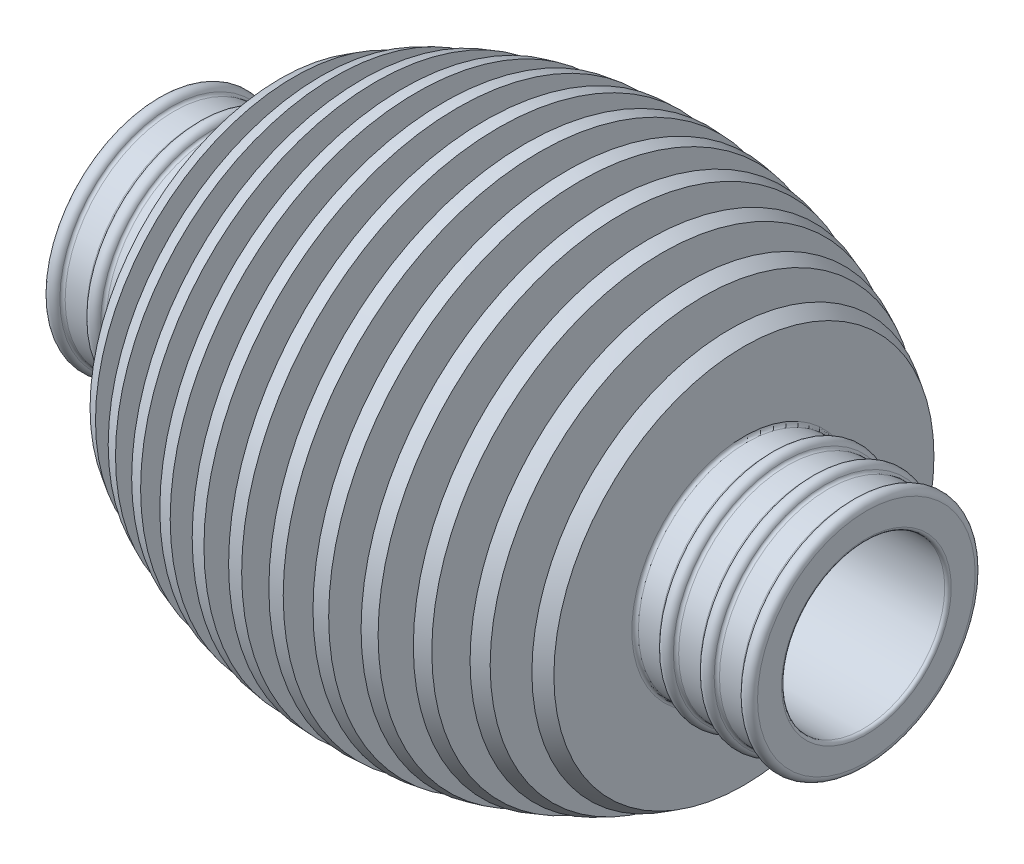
ISO-10303-21;
HEADER;
FILE_DESCRIPTION(('STEP AP214'),'2;1');
FILE_NAME('part.step','',(''),(''),'','','');
FILE_SCHEMA(('AUTOMOTIVE_DESIGN { 1 0 10303 214 1 1 1 1 }'));
ENDSEC;
DATA;
#1=APPLICATION_CONTEXT('core data for automotive mechanical design processes');
#2=APPLICATION_PROTOCOL_DEFINITION('international standard','automotive_design',2000,#1);
#3=PRODUCT_CONTEXT('',#1,'mechanical');
#4=PRODUCT('Part','Part','',(#3));
#5=PRODUCT_RELATED_PRODUCT_CATEGORY('part','',(#4));
#6=PRODUCT_DEFINITION_FORMATION('','',#4);
#7=PRODUCT_DEFINITION_CONTEXT('part definition',#1,'design');
#8=PRODUCT_DEFINITION('design','',#6,#7);
#9=PRODUCT_DEFINITION_SHAPE('','',#8);
#10=(LENGTH_UNIT() NAMED_UNIT(*) SI_UNIT(.MILLI.,.METRE.));
#11=(NAMED_UNIT(*) PLANE_ANGLE_UNIT() SI_UNIT($,.RADIAN.));
#12=(NAMED_UNIT(*) SI_UNIT($,.STERADIAN.) SOLID_ANGLE_UNIT());
#13=UNCERTAINTY_MEASURE_WITH_UNIT(LENGTH_MEASURE(1.E-05),#10,'distance_accuracy_value','');
#14=(GEOMETRIC_REPRESENTATION_CONTEXT(3) GLOBAL_UNCERTAINTY_ASSIGNED_CONTEXT((#13)) GLOBAL_UNIT_ASSIGNED_CONTEXT((#10,
#11,#12)) REPRESENTATION_CONTEXT('',''));
#15=CARTESIAN_POINT('',(0.,0.,0.));
#16=DIRECTION('',(0.,0.,1.));
#17=DIRECTION('',(1.,0.,0.));
#18=AXIS2_PLACEMENT_3D('',#15,#16,#17);
#19=CARTESIAN_POINT('',(68.41744,31.75,0.));
#20=DIRECTION('',(1.,0.,0.));
#21=DIRECTION('',(0.,0.,-1.));
#22=AXIS2_PLACEMENT_3D('',#19,#20,#21);
#23=PLANE('',#22);
#24=CARTESIAN_POINT('',(68.41744,0.,0.));
#25=DIRECTION('',(1.,0.,0.));
#26=DIRECTION('',(0.,0.,-1.));
#27=AXIS2_PLACEMENT_3D('',#24,#25,#26);
#28=CIRCLE('',#27,13.081);
#29=CARTESIAN_POINT('',(68.41744,0.,-13.081));
#30=VERTEX_POINT('',#29);
#31=EDGE_CURVE('E221',#30,#30,#28,.F.);
#32=ORIENTED_EDGE('',*,*,#31,.T.);
#33=EDGE_LOOP('',(#32));
#34=FACE_BOUND('',#33,.T.);
#35=CARTESIAN_POINT('',(68.41744,0.,0.));
#36=DIRECTION('',(1.,0.,0.));
#37=DIRECTION('',(0.,0.,-1.));
#38=AXIS2_PLACEMENT_3D('',#35,#36,#37);
#39=CIRCLE('',#38,22.1776575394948);
#40=CARTESIAN_POINT('',(68.41744,0.,-22.1776575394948));
#41=VERTEX_POINT('',#40);
#42=EDGE_CURVE('E275',#41,#41,#39,.F.);
#43=ORIENTED_EDGE('',*,*,#42,.F.);
#44=EDGE_LOOP('',(#43));
#45=FACE_BOUND('',#44,.T.);
#46=ADVANCED_FACE('F45',(#34,#45),#23,.T.);
#47=CARTESIAN_POINT('',(14.29004,12.7,0.));
#48=DIRECTION('',(-1.,0.,0.));
#49=DIRECTION('',(0.,0.,1.));
#50=AXIS2_PLACEMENT_3D('',#47,#48,#49);
#51=PLANE('',#50);
#52=CARTESIAN_POINT('',(14.29004,0.,0.));
#53=DIRECTION('',(-1.,0.,0.));
#54=DIRECTION('',(0.,0.,1.));
#55=AXIS2_PLACEMENT_3D('',#52,#53,#54);
#56=CIRCLE('',#55,13.081);
#57=CARTESIAN_POINT('',(14.29004,0.,13.081));
#58=VERTEX_POINT('',#57);
#59=EDGE_CURVE('E86',#58,#58,#56,.F.);
#60=ORIENTED_EDGE('',*,*,#59,.T.);
#61=EDGE_LOOP('',(#60));
#62=FACE_BOUND('',#61,.T.);
#63=CARTESIAN_POINT('',(14.29004,0.,0.));
#64=DIRECTION('',(-1.,0.,0.));
#65=DIRECTION('',(0.,0.,1.));
#66=AXIS2_PLACEMENT_3D('',#63,#64,#65);
#67=CIRCLE('',#66,22.1776575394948);
#68=CARTESIAN_POINT('',(14.29004,0.,22.1776575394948));
#69=VERTEX_POINT('',#68);
#70=EDGE_CURVE('E344',#69,#69,#67,.F.);
#71=ORIENTED_EDGE('',*,*,#70,.F.);
#72=EDGE_LOOP('',(#71));
#73=FACE_BOUND('',#72,.T.);
#74=ADVANCED_FACE('F350',(#62,#73),#51,.T.);
#75=CARTESIAN_POINT('',(0.,0.,0.));
#76=DIRECTION('',(1.,0.,0.));
#77=DIRECTION('',(0.,0.,-1.));
#78=AXIS2_PLACEMENT_3D('',#75,#76,#77);
#79=CYLINDRICAL_SURFACE('',#78,9.525);
#80=CARTESIAN_POINT('',(0.381,0.,0.));
#81=DIRECTION('',(-1.,0.,0.));
#82=DIRECTION('',(0.,0.,1.));
#83=AXIS2_PLACEMENT_3D('',#80,#81,#82);
#84=CIRCLE('',#83,9.525);
#85=CARTESIAN_POINT('',(0.381,0.,9.525));
#86=VERTEX_POINT('',#85);
#87=EDGE_CURVE('E260',#86,#86,#84,.T.);
#88=ORIENTED_EDGE('',*,*,#87,.T.);
#89=EDGE_LOOP('',(#88));
#90=FACE_BOUND('',#89,.T.);
#91=CARTESIAN_POINT('',(82.32648,0.,0.));
#92=DIRECTION('',(1.,0.,0.));
#93=DIRECTION('',(0.,0.,-1.));
#94=AXIS2_PLACEMENT_3D('',#91,#92,#93);
#95=CIRCLE('',#94,9.525);
#96=CARTESIAN_POINT('',(82.32648,0.,-9.525));
#97=VERTEX_POINT('',#96);
#98=EDGE_CURVE('E263',#97,#97,#95,.T.);
#99=ORIENTED_EDGE('',*,*,#98,.T.);
#100=EDGE_LOOP('',(#99));
#101=FACE_BOUND('',#100,.T.);
#102=ADVANCED_FACE('F352',(#90,#101),#79,.F.);
#103=CARTESIAN_POINT('',(82.70748,9.525,0.));
#104=DIRECTION('',(1.,0.,0.));
#105=DIRECTION('',(0.,0.,-1.));
#106=AXIS2_PLACEMENT_3D('',#103,#104,#105);
#107=PLANE('',#106);
#108=CARTESIAN_POINT('',(82.70748,0.,0.));
#109=DIRECTION('',(1.,0.,0.));
#110=DIRECTION('',(0.,0.,-1.));
#111=AXIS2_PLACEMENT_3D('',#108,#109,#110);
#112=CIRCLE('',#111,9.906);
#113=CARTESIAN_POINT('',(82.70748,0.,-9.906));
#114=VERTEX_POINT('',#113);
#115=EDGE_CURVE('E257',#114,#114,#112,.F.);
#116=ORIENTED_EDGE('',*,*,#115,.T.);
#117=EDGE_LOOP('',(#116));
#118=FACE_BOUND('',#117,.T.);
#119=CARTESIAN_POINT('',(82.70748,0.,0.));
#120=DIRECTION('',(1.,0.,0.));
#121=DIRECTION('',(0.,0.,-1.));
#122=AXIS2_PLACEMENT_3D('',#119,#120,#121);
#123=CIRCLE('',#122,12.7);
#124=CARTESIAN_POINT('',(82.70748,0.,-12.7));
#125=VERTEX_POINT('',#124);
#126=EDGE_CURVE('E269',#125,#125,#123,.T.);
#127=ORIENTED_EDGE('',*,*,#126,.T.);
#128=EDGE_LOOP('',(#127));
#129=FACE_BOUND('',#128,.T.);
#130=ADVANCED_FACE('F359',(#118,#129),#107,.T.);
#131=CARTESIAN_POINT('',(81.91246,0.,0.));
#132=DIRECTION('',(1.,0.,0.));
#133=DIRECTION('',(0.,0.,-1.));
#134=AXIS2_PLACEMENT_3D('',#131,#132,#133);
#135=TOROIDAL_SURFACE('',#134,12.7,0.795020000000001);
#136=CARTESIAN_POINT('',(81.1603186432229,0.,0.));
#137=DIRECTION('',(1.,0.,0.));
#138=DIRECTION('',(0.,0.,-1.));
#139=AXIS2_PLACEMENT_3D('',#136,#137,#138);
#140=CIRCLE('',#139,12.95756587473);
#141=CARTESIAN_POINT('',(81.1603186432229,0.,-12.95756587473));
#142=VERTEX_POINT('',#141);
#143=EDGE_CURVE('E242',#142,#142,#140,.T.);
#144=ORIENTED_EDGE('',*,*,#143,.T.);
#145=EDGE_LOOP('',(#144));
#146=FACE_BOUND('',#145,.T.);
#147=ORIENTED_EDGE('',*,*,#126,.F.);
#148=EDGE_LOOP('',(#147));
#149=FACE_BOUND('',#148,.T.);
#150=ADVANCED_FACE('F530',(#146,#149),#135,.T.);
#151=CARTESIAN_POINT('',(0.,0.,0.));
#152=DIRECTION('',(1.,0.,0.));
#153=DIRECTION('',(0.,0.,-1.));
#154=AXIS2_PLACEMENT_3D('',#151,#152,#153);
#155=CYLINDRICAL_SURFACE('',#154,12.7);
#156=CARTESIAN_POINT('',(78.262552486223,0.,0.));
#157=DIRECTION('',(1.,0.,0.));
#158=DIRECTION('',(0.,0.,-1.));
#159=AXIS2_PLACEMENT_3D('',#156,#157,#158);
#160=CIRCLE('',#159,12.7);
#161=CARTESIAN_POINT('',(78.262552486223,0.,-12.7));
#162=VERTEX_POINT('',#161);
#163=EDGE_CURVE('E251',#162,#162,#160,.T.);
#164=ORIENTED_EDGE('',*,*,#163,.T.);
#165=EDGE_LOOP('',(#164));
#166=FACE_BOUND('',#165,.T.);
#167=CARTESIAN_POINT('',(80.7998675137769,0.,0.));
#168=DIRECTION('',(1.,0.,0.));
#169=DIRECTION('',(0.,0.,-1.));
#170=AXIS2_PLACEMENT_3D('',#167,#168,#169);
#171=CIRCLE('',#170,12.7);
#172=CARTESIAN_POINT('',(80.7998675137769,0.,-12.7));
#173=VERTEX_POINT('',#172);
#174=EDGE_CURVE('E254',#173,#173,#171,.F.);
#175=ORIENTED_EDGE('',*,*,#174,.T.);
#176=EDGE_LOOP('',(#175));
#177=FACE_BOUND('',#176,.T.);
#178=ADVANCED_FACE('F526',(#166,#177),#155,.T.);
#179=CARTESIAN_POINT('',(77.14996,0.,0.));
#180=DIRECTION('',(1.,0.,0.));
#181=DIRECTION('',(0.,0.,-1.));
#182=AXIS2_PLACEMENT_3D('',#179,#180,#181);
#183=TOROIDAL_SURFACE('',#182,12.7,0.795020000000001);
#184=CARTESIAN_POINT('',(77.902101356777,0.,0.));
#185=DIRECTION('',(-1.,0.,0.));
#186=DIRECTION('',(0.,0.,1.));
#187=AXIS2_PLACEMENT_3D('',#184,#185,#186);
#188=CIRCLE('',#187,12.95756587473);
#189=CARTESIAN_POINT('',(77.902101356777,0.,12.95756587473));
#190=VERTEX_POINT('',#189);
#191=EDGE_CURVE('E245',#190,#190,#188,.T.);
#192=ORIENTED_EDGE('',*,*,#191,.T.);
#193=EDGE_LOOP('',(#192));
#194=FACE_BOUND('',#193,.T.);
#195=CARTESIAN_POINT('',(76.3978186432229,0.,0.));
#196=DIRECTION('',(1.,0.,0.));
#197=DIRECTION('',(0.,0.,-1.));
#198=AXIS2_PLACEMENT_3D('',#195,#196,#197);
#199=CIRCLE('',#198,12.95756587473);
#200=CARTESIAN_POINT('',(76.3978186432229,0.,-12.95756587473));
#201=VERTEX_POINT('',#200);
#202=EDGE_CURVE('E248',#201,#201,#199,.T.);
#203=ORIENTED_EDGE('',*,*,#202,.T.);
#204=EDGE_LOOP('',(#203));
#205=FACE_BOUND('',#204,.T.);
#206=ADVANCED_FACE('F522',(#194,#205),#183,.T.);
#207=CARTESIAN_POINT('',(0.,0.,0.));
#208=DIRECTION('',(1.,0.,0.));
#209=DIRECTION('',(0.,0.,-1.));
#210=AXIS2_PLACEMENT_3D('',#207,#208,#209);
#211=CYLINDRICAL_SURFACE('',#210,12.7);
#212=CARTESIAN_POINT('',(76.0373675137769,0.,0.));
#213=DIRECTION('',(1.,0.,0.));
#214=DIRECTION('',(0.,0.,-1.));
#215=AXIS2_PLACEMENT_3D('',#212,#213,#214);
#216=CIRCLE('',#215,12.7);
#217=CARTESIAN_POINT('',(76.0373675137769,0.,-12.7));
#218=VERTEX_POINT('',#217);
#219=EDGE_CURVE('E236',#218,#218,#216,.F.);
#220=ORIENTED_EDGE('',*,*,#219,.T.);
#221=EDGE_LOOP('',(#220));
#222=FACE_BOUND('',#221,.T.);
#223=CARTESIAN_POINT('',(73.500052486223,0.,0.));
#224=DIRECTION('',(1.,0.,0.));
#225=DIRECTION('',(0.,0.,-1.));
#226=AXIS2_PLACEMENT_3D('',#223,#224,#225);
#227=CIRCLE('',#226,12.7);
#228=CARTESIAN_POINT('',(73.500052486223,0.,-12.7));
#229=VERTEX_POINT('',#228);
#230=EDGE_CURVE('E239',#229,#229,#227,.T.);
#231=ORIENTED_EDGE('',*,*,#230,.T.);
#232=EDGE_LOOP('',(#231));
#233=FACE_BOUND('',#232,.T.);
#234=ADVANCED_FACE('F518',(#222,#233),#211,.T.);
#235=CARTESIAN_POINT('',(72.38746,0.,0.));
#236=DIRECTION('',(1.,0.,0.));
#237=DIRECTION('',(0.,0.,-1.));
#238=AXIS2_PLACEMENT_3D('',#235,#236,#237);
#239=TOROIDAL_SURFACE('',#238,12.7,0.795020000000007);
#240=CARTESIAN_POINT('',(73.1396013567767,0.,0.));
#241=DIRECTION('',(-1.,0.,0.));
#242=DIRECTION('',(0.,0.,1.));
#243=AXIS2_PLACEMENT_3D('',#240,#241,#242);
#244=CIRCLE('',#243,12.9575658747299);
#245=CARTESIAN_POINT('',(73.1396013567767,0.,12.9575658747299));
#246=VERTEX_POINT('',#245);
#247=EDGE_CURVE('E230',#246,#246,#244,.T.);
#248=ORIENTED_EDGE('',*,*,#247,.T.);
#249=EDGE_LOOP('',(#248));
#250=FACE_BOUND('',#249,.T.);
#251=CARTESIAN_POINT('',(71.6353186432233,0.,0.));
#252=DIRECTION('',(1.,0.,0.));
#253=DIRECTION('',(0.,0.,-1.));
#254=AXIS2_PLACEMENT_3D('',#251,#252,#253);
#255=CIRCLE('',#254,12.9575658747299);
#256=CARTESIAN_POINT('',(71.6353186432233,0.,-12.9575658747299));
#257=VERTEX_POINT('',#256);
#258=EDGE_CURVE('E233',#257,#257,#255,.T.);
#259=ORIENTED_EDGE('',*,*,#258,.T.);
#260=EDGE_LOOP('',(#259));
#261=FACE_BOUND('',#260,.T.);
#262=ADVANCED_FACE('F514',(#250,#261),#239,.T.);
#263=CARTESIAN_POINT('',(0.,0.,0.));
#264=DIRECTION('',(1.,0.,0.));
#265=DIRECTION('',(0.,0.,-1.));
#266=AXIS2_PLACEMENT_3D('',#263,#264,#265);
#267=CYLINDRICAL_SURFACE('',#266,12.7);
#268=CARTESIAN_POINT('',(71.2748675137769,0.,0.));
#269=DIRECTION('',(1.,0.,0.));
#270=DIRECTION('',(0.,0.,-1.));
#271=AXIS2_PLACEMENT_3D('',#268,#269,#270);
#272=CIRCLE('',#271,12.7);
#273=CARTESIAN_POINT('',(71.2748675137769,0.,-12.7));
#274=VERTEX_POINT('',#273);
#275=EDGE_CURVE('E224',#274,#274,#272,.F.);
#276=ORIENTED_EDGE('',*,*,#275,.T.);
#277=EDGE_LOOP('',(#276));
#278=FACE_BOUND('',#277,.T.);
#279=CARTESIAN_POINT('',(68.79844,0.,0.));
#280=DIRECTION('',(1.,0.,0.));
#281=DIRECTION('',(0.,0.,-1.));
#282=AXIS2_PLACEMENT_3D('',#279,#280,#281);
#283=CIRCLE('',#282,12.7);
#284=CARTESIAN_POINT('',(68.79844,0.,-12.7));
#285=VERTEX_POINT('',#284);
#286=EDGE_CURVE('E227',#285,#285,#283,.T.);
#287=ORIENTED_EDGE('',*,*,#286,.T.);
#288=EDGE_LOOP('',(#287));
#289=FACE_BOUND('',#288,.T.);
#290=ADVANCED_FACE('F511',(#278,#289),#267,.T.);
#291=CARTESIAN_POINT('',(0.,0.,0.));
#292=DIRECTION('',(1.,0.,0.));
#293=DIRECTION('',(0.,0.,-1.));
#294=AXIS2_PLACEMENT_3D('',#291,#292,#293);
#295=CYLINDRICAL_SURFACE('',#294,12.7);
#296=CARTESIAN_POINT('',(13.90904,0.,0.));
#297=DIRECTION('',(-1.,0.,0.));
#298=DIRECTION('',(0.,0.,1.));
#299=AXIS2_PLACEMENT_3D('',#296,#297,#298);
#300=CIRCLE('',#299,12.7);
#301=CARTESIAN_POINT('',(13.90904,0.,12.7));
#302=VERTEX_POINT('',#301);
#303=EDGE_CURVE('E80',#302,#302,#300,.T.);
#304=ORIENTED_EDGE('',*,*,#303,.T.);
#305=EDGE_LOOP('',(#304));
#306=FACE_BOUND('',#305,.T.);
#307=CARTESIAN_POINT('',(11.4326124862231,0.,0.));
#308=DIRECTION('',(1.,0.,0.));
#309=DIRECTION('',(0.,0.,-1.));
#310=AXIS2_PLACEMENT_3D('',#307,#308,#309);
#311=CIRCLE('',#310,12.7);
#312=CARTESIAN_POINT('',(11.4326124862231,0.,-12.7));
#313=VERTEX_POINT('',#312);
#314=EDGE_CURVE('E83',#313,#313,#311,.T.);
#315=ORIENTED_EDGE('',*,*,#314,.T.);
#316=EDGE_LOOP('',(#315));
#317=FACE_BOUND('',#316,.T.);
#318=ADVANCED_FACE('F366',(#306,#317),#295,.T.);
#319=CARTESIAN_POINT('',(10.32002,0.,0.));
#320=DIRECTION('',(1.,0.,0.));
#321=DIRECTION('',(0.,0.,-1.));
#322=AXIS2_PLACEMENT_3D('',#319,#320,#321);
#323=TOROIDAL_SURFACE('',#322,12.7,0.795020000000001);
#324=CARTESIAN_POINT('',(11.0721613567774,0.,0.));
#325=DIRECTION('',(-1.,0.,0.));
#326=DIRECTION('',(0.,0.,1.));
#327=AXIS2_PLACEMENT_3D('',#324,#325,#326);
#328=CIRCLE('',#327,12.9575658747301);
#329=CARTESIAN_POINT('',(11.0721613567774,0.,12.9575658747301));
#330=VERTEX_POINT('',#329);
#331=EDGE_CURVE('E74',#330,#330,#328,.T.);
#332=ORIENTED_EDGE('',*,*,#331,.T.);
#333=EDGE_LOOP('',(#332));
#334=FACE_BOUND('',#333,.T.);
#335=CARTESIAN_POINT('',(9.56787864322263,0.,0.));
#336=DIRECTION('',(1.,0.,0.));
#337=DIRECTION('',(0.,0.,-1.));
#338=AXIS2_PLACEMENT_3D('',#335,#336,#337);
#339=CIRCLE('',#338,12.9575658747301);
#340=CARTESIAN_POINT('',(9.56787864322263,0.,-12.9575658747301));
#341=VERTEX_POINT('',#340);
#342=EDGE_CURVE('E77',#341,#341,#339,.T.);
#343=ORIENTED_EDGE('',*,*,#342,.T.);
#344=EDGE_LOOP('',(#343));
#345=FACE_BOUND('',#344,.T.);
#346=ADVANCED_FACE('F695',(#334,#345),#323,.T.);
#347=CARTESIAN_POINT('',(0.,0.,0.));
#348=DIRECTION('',(1.,0.,0.));
#349=DIRECTION('',(0.,0.,-1.));
#350=AXIS2_PLACEMENT_3D('',#347,#348,#349);
#351=CYLINDRICAL_SURFACE('',#350,12.7);
#352=CARTESIAN_POINT('',(9.20742751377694,0.,0.));
#353=DIRECTION('',(1.,0.,0.));
#354=DIRECTION('',(0.,0.,-1.));
#355=AXIS2_PLACEMENT_3D('',#352,#353,#354);
#356=CIRCLE('',#355,12.7);
#357=CARTESIAN_POINT('',(9.20742751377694,0.,-12.7));
#358=VERTEX_POINT('',#357);
#359=EDGE_CURVE('E68',#358,#358,#356,.F.);
#360=ORIENTED_EDGE('',*,*,#359,.T.);
#361=EDGE_LOOP('',(#360));
#362=FACE_BOUND('',#361,.T.);
#363=CARTESIAN_POINT('',(6.67011248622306,0.,0.));
#364=DIRECTION('',(1.,0.,0.));
#365=DIRECTION('',(0.,0.,-1.));
#366=AXIS2_PLACEMENT_3D('',#363,#364,#365);
#367=CIRCLE('',#366,12.7);
#368=CARTESIAN_POINT('',(6.67011248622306,0.,-12.7));
#369=VERTEX_POINT('',#368);
#370=EDGE_CURVE('E71',#369,#369,#367,.T.);
#371=ORIENTED_EDGE('',*,*,#370,.T.);
#372=EDGE_LOOP('',(#371));
#373=FACE_BOUND('',#372,.T.);
#374=ADVANCED_FACE('F686',(#362,#373),#351,.T.);
#375=CARTESIAN_POINT('',(5.55752,0.,0.));
#376=DIRECTION('',(1.,0.,0.));
#377=DIRECTION('',(0.,0.,-1.));
#378=AXIS2_PLACEMENT_3D('',#375,#376,#377);
#379=TOROIDAL_SURFACE('',#378,12.7,0.795020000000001);
#380=CARTESIAN_POINT('',(6.30966135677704,0.,0.));
#381=DIRECTION('',(-1.,0.,0.));
#382=DIRECTION('',(0.,0.,1.));
#383=AXIS2_PLACEMENT_3D('',#380,#381,#382);
#384=CIRCLE('',#383,12.95756587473);
#385=CARTESIAN_POINT('',(6.30966135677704,0.,12.95756587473));
#386=VERTEX_POINT('',#385);
#387=EDGE_CURVE('E60',#386,#386,#384,.T.);
#388=ORIENTED_EDGE('',*,*,#387,.T.);
#389=EDGE_LOOP('',(#388));
#390=FACE_BOUND('',#389,.T.);
#391=CARTESIAN_POINT('',(4.80537864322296,0.,0.));
#392=DIRECTION('',(1.,0.,0.));
#393=DIRECTION('',(0.,0.,-1.));
#394=AXIS2_PLACEMENT_3D('',#391,#392,#393);
#395=CIRCLE('',#394,12.95756587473);
#396=CARTESIAN_POINT('',(4.80537864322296,0.,-12.95756587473));
#397=VERTEX_POINT('',#396);
#398=EDGE_CURVE('E65',#397,#397,#395,.T.);
#399=ORIENTED_EDGE('',*,*,#398,.T.);
#400=EDGE_LOOP('',(#399));
#401=FACE_BOUND('',#400,.T.);
#402=ADVANCED_FACE('F683',(#390,#401),#379,.T.);
#403=CARTESIAN_POINT('',(0.,0.,0.));
#404=DIRECTION('',(1.,0.,0.));
#405=DIRECTION('',(0.,0.,-1.));
#406=AXIS2_PLACEMENT_3D('',#403,#404,#405);
#407=CYLINDRICAL_SURFACE('',#406,12.7);
#408=CARTESIAN_POINT('',(4.44492751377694,0.,0.));
#409=DIRECTION('',(1.,0.,0.));
#410=DIRECTION('',(0.,0.,-1.));
#411=AXIS2_PLACEMENT_3D('',#408,#409,#410);
#412=CIRCLE('',#411,12.7);
#413=CARTESIAN_POINT('',(4.44492751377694,0.,-12.7));
#414=VERTEX_POINT('',#413);
#415=EDGE_CURVE('E52',#414,#414,#412,.F.);
#416=ORIENTED_EDGE('',*,*,#415,.T.);
#417=EDGE_LOOP('',(#416));
#418=FACE_BOUND('',#417,.T.);
#419=CARTESIAN_POINT('',(1.90761248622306,0.,0.));
#420=DIRECTION('',(1.,0.,0.));
#421=DIRECTION('',(0.,0.,-1.));
#422=AXIS2_PLACEMENT_3D('',#419,#420,#421);
#423=CIRCLE('',#422,12.7);
#424=CARTESIAN_POINT('',(1.90761248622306,0.,-12.7));
#425=VERTEX_POINT('',#424);
#426=EDGE_CURVE('E56',#425,#425,#423,.T.);
#427=ORIENTED_EDGE('',*,*,#426,.T.);
#428=EDGE_LOOP('',(#427));
#429=FACE_BOUND('',#428,.T.);
#430=ADVANCED_FACE('F685',(#418,#429),#407,.T.);
#431=CARTESIAN_POINT('',(0.79502,0.,0.));
#432=DIRECTION('',(1.,0.,0.));
#433=DIRECTION('',(0.,0.,-1.));
#434=AXIS2_PLACEMENT_3D('',#431,#432,#433);
#435=TOROIDAL_SURFACE('',#434,12.7,0.79502);
#436=CARTESIAN_POINT('',(1.54716135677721,0.,0.));
#437=DIRECTION('',(-1.,0.,0.));
#438=DIRECTION('',(0.,0.,1.));
#439=AXIS2_PLACEMENT_3D('',#436,#437,#438);
#440=CIRCLE('',#439,12.95756587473);
#441=CARTESIAN_POINT('',(1.54716135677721,0.,12.95756587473));
#442=VERTEX_POINT('',#441);
#443=EDGE_CURVE('E12',#442,#442,#440,.T.);
#444=ORIENTED_EDGE('',*,*,#443,.T.);
#445=EDGE_LOOP('',(#444));
#446=FACE_BOUND('',#445,.T.);
#447=CARTESIAN_POINT('',(0.,0.,0.));
#448=DIRECTION('',(1.,0.,0.));
#449=DIRECTION('',(0.,0.,-1.));
#450=AXIS2_PLACEMENT_3D('',#447,#448,#449);
#451=CIRCLE('',#450,12.7);
#452=CARTESIAN_POINT('',(0.,0.,-12.7));
#453=VERTEX_POINT('',#452);
#454=EDGE_CURVE('E272',#453,#453,#451,.T.);
#455=ORIENTED_EDGE('',*,*,#454,.T.);
#456=EDGE_LOOP('',(#455));
#457=FACE_BOUND('',#456,.T.);
#458=ADVANCED_FACE('F693',(#446,#457),#435,.T.);
#459=CARTESIAN_POINT('',(0.,9.525,0.));
#460=DIRECTION('',(-1.,0.,0.));
#461=DIRECTION('',(0.,0.,1.));
#462=AXIS2_PLACEMENT_3D('',#459,#460,#461);
#463=PLANE('',#462);
#464=CARTESIAN_POINT('',(0.,0.,0.));
#465=DIRECTION('',(-1.,0.,0.));
#466=DIRECTION('',(0.,0.,1.));
#467=AXIS2_PLACEMENT_3D('',#464,#465,#466);
#468=CIRCLE('',#467,9.906);
#469=CARTESIAN_POINT('',(0.,0.,9.906));
#470=VERTEX_POINT('',#469);
#471=EDGE_CURVE('E266',#470,#470,#468,.F.);
#472=ORIENTED_EDGE('',*,*,#471,.T.);
#473=EDGE_LOOP('',(#472));
#474=FACE_BOUND('',#473,.T.);
#475=ORIENTED_EDGE('',*,*,#454,.F.);
#476=EDGE_LOOP('',(#475));
#477=FACE_BOUND('',#476,.T.);
#478=ADVANCED_FACE('F860',(#474,#477),#463,.T.);
#479=CARTESIAN_POINT('',(41.35374,0.,0.));
#480=DIRECTION('',(1.,0.,0.));
#481=DIRECTION('',(0.,0.,-1.));
#482=AXIS2_PLACEMENT_3D('',#479,#480,#481);
#483=DEGENERATE_TOROIDAL_SURFACE('',#482,20.8129942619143,50.8,.F.);
#484=CARTESIAN_POINT('',(15.89024,0.,0.));
#485=DIRECTION('',(1.,0.,0.));
#486=DIRECTION('',(0.,0.,-1.));
#487=AXIS2_PLACEMENT_3D('',#484,#485,#486);
#488=CIRCLE('',#487,23.1443733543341);
#489=CARTESIAN_POINT('',(15.89024,0.,-23.1443733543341));
#490=VERTEX_POINT('',#489);
#491=EDGE_CURVE('E341',#490,#490,#488,.F.);
#492=ORIENTED_EDGE('',*,*,#491,.T.);
#493=EDGE_LOOP('',(#492));
#494=FACE_BOUND('',#493,.T.);
#495=ORIENTED_EDGE('',*,*,#70,.T.);
#496=EDGE_LOOP('',(#495));
#497=FACE_BOUND('',#496,.T.);
#498=ADVANCED_FACE('F348',(#494,#497),#483,.F.);
#499=CARTESIAN_POINT('',(19.06524,12.7,0.));
#500=DIRECTION('',(-1.,0.,0.));
#501=DIRECTION('',(0.,0.,1.));
#502=AXIS2_PLACEMENT_3D('',#499,#500,#501);
#503=PLANE('',#502);
#504=CARTESIAN_POINT('',(19.06524,0.,0.));
#505=DIRECTION('',(-1.,0.,0.));
#506=DIRECTION('',(0.,0.,1.));
#507=AXIS2_PLACEMENT_3D('',#504,#505,#506);
#508=CIRCLE('',#507,13.081);
#509=CARTESIAN_POINT('',(19.06524,0.,13.081));
#510=VERTEX_POINT('',#509);
#511=EDGE_CURVE('E98',#510,#510,#508,.F.);
#512=ORIENTED_EDGE('',*,*,#511,.T.);
#513=EDGE_LOOP('',(#512));
#514=FACE_BOUND('',#513,.T.);
#515=CARTESIAN_POINT('',(19.06524,0.,0.));
#516=DIRECTION('',(-1.,0.,0.));
#517=DIRECTION('',(0.,0.,1.));
#518=AXIS2_PLACEMENT_3D('',#515,#516,#517);
#519=CIRCLE('',#518,24.836351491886);
#520=CARTESIAN_POINT('',(19.06524,0.,24.836351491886));
#521=VERTEX_POINT('',#520);
#522=EDGE_CURVE('E338',#521,#521,#519,.F.);
#523=ORIENTED_EDGE('',*,*,#522,.F.);
#524=EDGE_LOOP('',(#523));
#525=FACE_BOUND('',#524,.T.);
#526=ADVANCED_FACE('F376',(#514,#525),#503,.T.);
#527=CARTESIAN_POINT('',(0.,0.,0.));
#528=DIRECTION('',(1.,0.,0.));
#529=DIRECTION('',(0.,0.,-1.));
#530=AXIS2_PLACEMENT_3D('',#527,#528,#529);
#531=CYLINDRICAL_SURFACE('',#530,12.7);
#532=CARTESIAN_POINT('',(18.68424,0.,0.));
#533=DIRECTION('',(-1.,0.,0.));
#534=DIRECTION('',(0.,0.,1.));
#535=AXIS2_PLACEMENT_3D('',#532,#533,#534);
#536=CIRCLE('',#535,12.7);
#537=CARTESIAN_POINT('',(18.68424,0.,12.7));
#538=VERTEX_POINT('',#537);
#539=EDGE_CURVE('E92',#538,#538,#536,.T.);
#540=ORIENTED_EDGE('',*,*,#539,.T.);
#541=EDGE_LOOP('',(#540));
#542=FACE_BOUND('',#541,.T.);
#543=CARTESIAN_POINT('',(16.27124,0.,0.));
#544=DIRECTION('',(1.,0.,0.));
#545=DIRECTION('',(0.,0.,-1.));
#546=AXIS2_PLACEMENT_3D('',#543,#544,#545);
#547=CIRCLE('',#546,12.7);
#548=CARTESIAN_POINT('',(16.27124,0.,-12.7));
#549=VERTEX_POINT('',#548);
#550=EDGE_CURVE('E95',#549,#549,#547,.T.);
#551=ORIENTED_EDGE('',*,*,#550,.T.);
#552=EDGE_LOOP('',(#551));
#553=FACE_BOUND('',#552,.T.);
#554=ADVANCED_FACE('F372',(#542,#553),#531,.T.);
#555=CARTESIAN_POINT('',(15.89024,31.75,0.));
#556=DIRECTION('',(1.,0.,0.));
#557=DIRECTION('',(0.,0.,-1.));
#558=AXIS2_PLACEMENT_3D('',#555,#556,#557);
#559=PLANE('',#558);
#560=CARTESIAN_POINT('',(15.89024,0.,0.));
#561=DIRECTION('',(1.,0.,0.));
#562=DIRECTION('',(0.,0.,-1.));
#563=AXIS2_PLACEMENT_3D('',#560,#561,#562);
#564=CIRCLE('',#563,13.081);
#565=CARTESIAN_POINT('',(15.89024,0.,-13.081));
#566=VERTEX_POINT('',#565);
#567=EDGE_CURVE('E89',#566,#566,#564,.F.);
#568=ORIENTED_EDGE('',*,*,#567,.T.);
#569=EDGE_LOOP('',(#568));
#570=FACE_BOUND('',#569,.T.);
#571=ORIENTED_EDGE('',*,*,#491,.F.);
#572=EDGE_LOOP('',(#571));
#573=FACE_BOUND('',#572,.T.);
#574=ADVANCED_FACE('F368',(#570,#573),#559,.T.);
#575=CARTESIAN_POINT('',(20.66544,0.,0.));
#576=DIRECTION('',(1.,0.,0.));
#577=DIRECTION('',(0.,0.,-1.));
#578=AXIS2_PLACEMENT_3D('',#575,#576,#577);
#579=CIRCLE('',#578,25.5834952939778);
#580=CARTESIAN_POINT('',(20.66544,0.,-25.5834952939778));
#581=VERTEX_POINT('',#580);
#582=EDGE_CURVE('E335',#581,#581,#579,.F.);
#583=ORIENTED_EDGE('',*,*,#582,.T.);
#584=EDGE_LOOP('',(#583));
#585=FACE_BOUND('',#584,.T.);
#586=ORIENTED_EDGE('',*,*,#522,.T.);
#587=EDGE_LOOP('',(#586));
#588=FACE_BOUND('',#587,.T.);
#589=ADVANCED_FACE('F371',(#585,#588),#483,.F.);
#590=CARTESIAN_POINT('',(23.84044,12.7,0.));
#591=DIRECTION('',(-1.,0.,0.));
#592=DIRECTION('',(0.,0.,1.));
#593=AXIS2_PLACEMENT_3D('',#590,#591,#592);
#594=PLANE('',#593);
#595=CARTESIAN_POINT('',(23.84044,0.,0.));
#596=DIRECTION('',(-1.,0.,0.));
#597=DIRECTION('',(0.,0.,1.));
#598=AXIS2_PLACEMENT_3D('',#595,#596,#597);
#599=CIRCLE('',#598,13.081);
#600=CARTESIAN_POINT('',(23.84044,0.,13.081));
#601=VERTEX_POINT('',#600);
#602=EDGE_CURVE('E110',#601,#601,#599,.F.);
#603=ORIENTED_EDGE('',*,*,#602,.T.);
#604=EDGE_LOOP('',(#603));
#605=FACE_BOUND('',#604,.T.);
#606=CARTESIAN_POINT('',(23.84044,0.,0.));
#607=DIRECTION('',(-1.,0.,0.));
#608=DIRECTION('',(0.,0.,1.));
#609=AXIS2_PLACEMENT_3D('',#606,#607,#608);
#610=CIRCLE('',#609,26.8726883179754);
#611=CARTESIAN_POINT('',(23.84044,0.,26.8726883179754));
#612=VERTEX_POINT('',#611);
#613=EDGE_CURVE('E332',#612,#612,#610,.F.);
#614=ORIENTED_EDGE('',*,*,#613,.F.);
#615=EDGE_LOOP('',(#614));
#616=FACE_BOUND('',#615,.T.);
#617=ADVANCED_FACE('F389',(#605,#616),#594,.T.);
#618=CARTESIAN_POINT('',(0.,0.,0.));
#619=DIRECTION('',(1.,0.,0.));
#620=DIRECTION('',(0.,0.,-1.));
#621=AXIS2_PLACEMENT_3D('',#618,#619,#620);
#622=CYLINDRICAL_SURFACE('',#621,12.7);
#623=CARTESIAN_POINT('',(23.45944,0.,0.));
#624=DIRECTION('',(-1.,0.,0.));
#625=DIRECTION('',(0.,0.,1.));
#626=AXIS2_PLACEMENT_3D('',#623,#624,#625);
#627=CIRCLE('',#626,12.7);
#628=CARTESIAN_POINT('',(23.45944,0.,12.7));
#629=VERTEX_POINT('',#628);
#630=EDGE_CURVE('E104',#629,#629,#627,.T.);
#631=ORIENTED_EDGE('',*,*,#630,.T.);
#632=EDGE_LOOP('',(#631));
#633=FACE_BOUND('',#632,.T.);
#634=CARTESIAN_POINT('',(21.04644,0.,0.));
#635=DIRECTION('',(1.,0.,0.));
#636=DIRECTION('',(0.,0.,-1.));
#637=AXIS2_PLACEMENT_3D('',#634,#635,#636);
#638=CIRCLE('',#637,12.7);
#639=CARTESIAN_POINT('',(21.04644,0.,-12.7));
#640=VERTEX_POINT('',#639);
#641=EDGE_CURVE('E107',#640,#640,#638,.T.);
#642=ORIENTED_EDGE('',*,*,#641,.T.);
#643=EDGE_LOOP('',(#642));
#644=FACE_BOUND('',#643,.T.);
#645=ADVANCED_FACE('F385',(#633,#644),#622,.T.);
#646=CARTESIAN_POINT('',(20.66544,31.75,0.));
#647=DIRECTION('',(1.,0.,0.));
#648=DIRECTION('',(0.,0.,-1.));
#649=AXIS2_PLACEMENT_3D('',#646,#647,#648);
#650=PLANE('',#649);
#651=CARTESIAN_POINT('',(20.66544,0.,0.));
#652=DIRECTION('',(1.,0.,0.));
#653=DIRECTION('',(0.,0.,-1.));
#654=AXIS2_PLACEMENT_3D('',#651,#652,#653);
#655=CIRCLE('',#654,13.081);
#656=CARTESIAN_POINT('',(20.66544,0.,-13.081));
#657=VERTEX_POINT('',#656);
#658=EDGE_CURVE('E101',#657,#657,#655,.F.);
#659=ORIENTED_EDGE('',*,*,#658,.T.);
#660=EDGE_LOOP('',(#659));
#661=FACE_BOUND('',#660,.T.);
#662=ORIENTED_EDGE('',*,*,#582,.F.);
#663=EDGE_LOOP('',(#662));
#664=FACE_BOUND('',#663,.T.);
#665=ADVANCED_FACE('F381',(#661,#664),#650,.T.);
#666=CARTESIAN_POINT('',(25.44064,0.,0.));
#667=DIRECTION('',(1.,0.,0.));
#668=DIRECTION('',(0.,0.,-1.));
#669=AXIS2_PLACEMENT_3D('',#666,#667,#668);
#670=CIRCLE('',#669,27.4302772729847);
#671=CARTESIAN_POINT('',(25.44064,0.,-27.4302772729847));
#672=VERTEX_POINT('',#671);
#673=EDGE_CURVE('E329',#672,#672,#670,.F.);
#674=ORIENTED_EDGE('',*,*,#673,.T.);
#675=EDGE_LOOP('',(#674));
#676=FACE_BOUND('',#675,.T.);
#677=ORIENTED_EDGE('',*,*,#613,.T.);
#678=EDGE_LOOP('',(#677));
#679=FACE_BOUND('',#678,.T.);
#680=ADVANCED_FACE('F384',(#676,#679),#483,.F.);
#681=CARTESIAN_POINT('',(28.61564,12.7,0.));
#682=DIRECTION('',(-1.,0.,0.));
#683=DIRECTION('',(0.,0.,1.));
#684=AXIS2_PLACEMENT_3D('',#681,#682,#683);
#685=PLANE('',#684);
#686=CARTESIAN_POINT('',(28.61564,0.,0.));
#687=DIRECTION('',(-1.,0.,0.));
#688=DIRECTION('',(0.,0.,1.));
#689=AXIS2_PLACEMENT_3D('',#686,#687,#688);
#690=CIRCLE('',#689,13.081);
#691=CARTESIAN_POINT('',(28.61564,0.,13.081));
#692=VERTEX_POINT('',#691);
#693=EDGE_CURVE('E122',#692,#692,#690,.F.);
#694=ORIENTED_EDGE('',*,*,#693,.T.);
#695=EDGE_LOOP('',(#694));
#696=FACE_BOUND('',#695,.T.);
#697=CARTESIAN_POINT('',(28.61564,0.,0.));
#698=DIRECTION('',(-1.,0.,0.));
#699=DIRECTION('',(0.,0.,1.));
#700=AXIS2_PLACEMENT_3D('',#697,#698,#699);
#701=CIRCLE('',#700,28.3640411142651);
#702=CARTESIAN_POINT('',(28.61564,0.,28.3640411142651));
#703=VERTEX_POINT('',#702);
#704=EDGE_CURVE('E326',#703,#703,#701,.F.);
#705=ORIENTED_EDGE('',*,*,#704,.F.);
#706=EDGE_LOOP('',(#705));
#707=FACE_BOUND('',#706,.T.);
#708=ADVANCED_FACE('F402',(#696,#707),#685,.T.);
#709=CARTESIAN_POINT('',(0.,0.,0.));
#710=DIRECTION('',(1.,0.,0.));
#711=DIRECTION('',(0.,0.,-1.));
#712=AXIS2_PLACEMENT_3D('',#709,#710,#711);
#713=CYLINDRICAL_SURFACE('',#712,12.7);
#714=CARTESIAN_POINT('',(28.23464,0.,0.));
#715=DIRECTION('',(-1.,0.,0.));
#716=DIRECTION('',(0.,0.,1.));
#717=AXIS2_PLACEMENT_3D('',#714,#715,#716);
#718=CIRCLE('',#717,12.7);
#719=CARTESIAN_POINT('',(28.23464,0.,12.7));
#720=VERTEX_POINT('',#719);
#721=EDGE_CURVE('E116',#720,#720,#718,.T.);
#722=ORIENTED_EDGE('',*,*,#721,.T.);
#723=EDGE_LOOP('',(#722));
#724=FACE_BOUND('',#723,.T.);
#725=CARTESIAN_POINT('',(25.82164,0.,0.));
#726=DIRECTION('',(1.,0.,0.));
#727=DIRECTION('',(0.,0.,-1.));
#728=AXIS2_PLACEMENT_3D('',#725,#726,#727);
#729=CIRCLE('',#728,12.7);
#730=CARTESIAN_POINT('',(25.82164,0.,-12.7));
#731=VERTEX_POINT('',#730);
#732=EDGE_CURVE('E119',#731,#731,#729,.T.);
#733=ORIENTED_EDGE('',*,*,#732,.T.);
#734=EDGE_LOOP('',(#733));
#735=FACE_BOUND('',#734,.T.);
#736=ADVANCED_FACE('F398',(#724,#735),#713,.T.);
#737=CARTESIAN_POINT('',(25.44064,31.75,0.));
#738=DIRECTION('',(1.,0.,0.));
#739=DIRECTION('',(0.,0.,-1.));
#740=AXIS2_PLACEMENT_3D('',#737,#738,#739);
#741=PLANE('',#740);
#742=CARTESIAN_POINT('',(25.44064,0.,0.));
#743=DIRECTION('',(1.,0.,0.));
#744=DIRECTION('',(0.,0.,-1.));
#745=AXIS2_PLACEMENT_3D('',#742,#743,#744);
#746=CIRCLE('',#745,13.081);
#747=CARTESIAN_POINT('',(25.44064,0.,-13.081));
#748=VERTEX_POINT('',#747);
#749=EDGE_CURVE('E113',#748,#748,#746,.F.);
#750=ORIENTED_EDGE('',*,*,#749,.T.);
#751=EDGE_LOOP('',(#750));
#752=FACE_BOUND('',#751,.T.);
#753=ORIENTED_EDGE('',*,*,#673,.F.);
#754=EDGE_LOOP('',(#753));
#755=FACE_BOUND('',#754,.T.);
#756=ADVANCED_FACE('F394',(#752,#755),#741,.T.);
#757=CARTESIAN_POINT('',(30.21584,0.,0.));
#758=DIRECTION('',(1.,0.,0.));
#759=DIRECTION('',(0.,0.,-1.));
#760=AXIS2_PLACEMENT_3D('',#757,#758,#759);
#761=CIRCLE('',#760,28.7509763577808);
#762=CARTESIAN_POINT('',(30.21584,0.,-28.7509763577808));
#763=VERTEX_POINT('',#762);
#764=EDGE_CURVE('E323',#763,#763,#761,.F.);
#765=ORIENTED_EDGE('',*,*,#764,.T.);
#766=EDGE_LOOP('',(#765));
#767=FACE_BOUND('',#766,.T.);
#768=ORIENTED_EDGE('',*,*,#704,.T.);
#769=EDGE_LOOP('',(#768));
#770=FACE_BOUND('',#769,.T.);
#771=ADVANCED_FACE('F397',(#767,#770),#483,.F.);
#772=CARTESIAN_POINT('',(33.39084,12.7,0.));
#773=DIRECTION('',(-1.,0.,0.));
#774=DIRECTION('',(0.,0.,1.));
#775=AXIS2_PLACEMENT_3D('',#772,#773,#774);
#776=PLANE('',#775);
#777=CARTESIAN_POINT('',(33.39084,0.,0.));
#778=DIRECTION('',(-1.,0.,0.));
#779=DIRECTION('',(0.,0.,1.));
#780=AXIS2_PLACEMENT_3D('',#777,#778,#779);
#781=CIRCLE('',#780,13.081);
#782=CARTESIAN_POINT('',(33.39084,0.,13.081));
#783=VERTEX_POINT('',#782);
#784=EDGE_CURVE('E134',#783,#783,#781,.F.);
#785=ORIENTED_EDGE('',*,*,#784,.T.);
#786=EDGE_LOOP('',(#785));
#787=FACE_BOUND('',#786,.T.);
#788=CARTESIAN_POINT('',(33.39084,0.,0.));
#789=DIRECTION('',(-1.,0.,0.));
#790=DIRECTION('',(0.,0.,1.));
#791=AXIS2_PLACEMENT_3D('',#788,#789,#790);
#792=CIRCLE('',#791,29.3590320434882);
#793=CARTESIAN_POINT('',(33.39084,0.,29.3590320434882));
#794=VERTEX_POINT('',#793);
#795=EDGE_CURVE('E320',#794,#794,#792,.F.);
#796=ORIENTED_EDGE('',*,*,#795,.F.);
#797=EDGE_LOOP('',(#796));
#798=FACE_BOUND('',#797,.T.);
#799=ADVANCED_FACE('F415',(#787,#798),#776,.T.);
#800=CARTESIAN_POINT('',(0.,0.,0.));
#801=DIRECTION('',(1.,0.,0.));
#802=DIRECTION('',(0.,0.,-1.));
#803=AXIS2_PLACEMENT_3D('',#800,#801,#802);
#804=CYLINDRICAL_SURFACE('',#803,12.7);
#805=CARTESIAN_POINT('',(33.00984,0.,0.));
#806=DIRECTION('',(-1.,0.,0.));
#807=DIRECTION('',(0.,0.,1.));
#808=AXIS2_PLACEMENT_3D('',#805,#806,#807);
#809=CIRCLE('',#808,12.7);
#810=CARTESIAN_POINT('',(33.00984,0.,12.7));
#811=VERTEX_POINT('',#810);
#812=EDGE_CURVE('E128',#811,#811,#809,.T.);
#813=ORIENTED_EDGE('',*,*,#812,.T.);
#814=EDGE_LOOP('',(#813));
#815=FACE_BOUND('',#814,.T.);
#816=CARTESIAN_POINT('',(30.59684,0.,0.));
#817=DIRECTION('',(1.,0.,0.));
#818=DIRECTION('',(0.,0.,-1.));
#819=AXIS2_PLACEMENT_3D('',#816,#817,#818);
#820=CIRCLE('',#819,12.7);
#821=CARTESIAN_POINT('',(30.59684,0.,-12.7));
#822=VERTEX_POINT('',#821);
#823=EDGE_CURVE('E131',#822,#822,#820,.T.);
#824=ORIENTED_EDGE('',*,*,#823,.T.);
#825=EDGE_LOOP('',(#824));
#826=FACE_BOUND('',#825,.T.);
#827=ADVANCED_FACE('F411',(#815,#826),#804,.T.);
#828=CARTESIAN_POINT('',(30.21584,31.75,0.));
#829=DIRECTION('',(1.,0.,0.));
#830=DIRECTION('',(0.,0.,-1.));
#831=AXIS2_PLACEMENT_3D('',#828,#829,#830);
#832=PLANE('',#831);
#833=CARTESIAN_POINT('',(30.21584,0.,0.));
#834=DIRECTION('',(1.,0.,0.));
#835=DIRECTION('',(0.,0.,-1.));
#836=AXIS2_PLACEMENT_3D('',#833,#834,#835);
#837=CIRCLE('',#836,13.081);
#838=CARTESIAN_POINT('',(30.21584,0.,-13.081));
#839=VERTEX_POINT('',#838);
#840=EDGE_CURVE('E125',#839,#839,#837,.F.);
#841=ORIENTED_EDGE('',*,*,#840,.T.);
#842=EDGE_LOOP('',(#841));
#843=FACE_BOUND('',#842,.T.);
#844=ORIENTED_EDGE('',*,*,#764,.F.);
#845=EDGE_LOOP('',(#844));
#846=FACE_BOUND('',#845,.T.);
#847=ADVANCED_FACE('F407',(#843,#846),#832,.T.);
#848=CARTESIAN_POINT('',(34.99104,0.,0.));
#849=DIRECTION('',(1.,0.,0.));
#850=DIRECTION('',(0.,0.,-1.));
#851=AXIS2_PLACEMENT_3D('',#848,#849,#850);
#852=CIRCLE('',#851,29.5869665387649);
#853=CARTESIAN_POINT('',(34.99104,0.,-29.5869665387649));
#854=VERTEX_POINT('',#853);
#855=EDGE_CURVE('E317',#854,#854,#852,.F.);
#856=ORIENTED_EDGE('',*,*,#855,.T.);
#857=EDGE_LOOP('',(#856));
#858=FACE_BOUND('',#857,.T.);
#859=ORIENTED_EDGE('',*,*,#795,.T.);
#860=EDGE_LOOP('',(#859));
#861=FACE_BOUND('',#860,.T.);
#862=ADVANCED_FACE('F410',(#858,#861),#483,.F.);
#863=CARTESIAN_POINT('',(38.16604,12.7,0.));
#864=DIRECTION('',(-1.,0.,0.));
#865=DIRECTION('',(0.,0.,1.));
#866=AXIS2_PLACEMENT_3D('',#863,#864,#865);
#867=PLANE('',#866);
#868=CARTESIAN_POINT('',(38.16604,0.,0.));
#869=DIRECTION('',(-1.,0.,0.));
#870=DIRECTION('',(0.,0.,1.));
#871=AXIS2_PLACEMENT_3D('',#868,#869,#870);
#872=CIRCLE('',#871,13.081);
#873=CARTESIAN_POINT('',(38.16604,0.,13.081));
#874=VERTEX_POINT('',#873);
#875=EDGE_CURVE('E146',#874,#874,#872,.F.);
#876=ORIENTED_EDGE('',*,*,#875,.T.);
#877=EDGE_LOOP('',(#876));
#878=FACE_BOUND('',#877,.T.);
#879=CARTESIAN_POINT('',(38.16604,0.,0.));
#880=DIRECTION('',(-1.,0.,0.));
#881=DIRECTION('',(0.,0.,1.));
#882=AXIS2_PLACEMENT_3D('',#879,#880,#881);
#883=CIRCLE('',#882,29.886893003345);
#884=CARTESIAN_POINT('',(38.16604,0.,29.886893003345));
#885=VERTEX_POINT('',#884);
#886=EDGE_CURVE('E314',#885,#885,#883,.F.);
#887=ORIENTED_EDGE('',*,*,#886,.F.);
#888=EDGE_LOOP('',(#887));
#889=FACE_BOUND('',#888,.T.);
#890=ADVANCED_FACE('F428',(#878,#889),#867,.T.);
#891=CARTESIAN_POINT('',(0.,0.,0.));
#892=DIRECTION('',(1.,0.,0.));
#893=DIRECTION('',(0.,0.,-1.));
#894=AXIS2_PLACEMENT_3D('',#891,#892,#893);
#895=CYLINDRICAL_SURFACE('',#894,12.7);
#896=CARTESIAN_POINT('',(37.78504,0.,0.));
#897=DIRECTION('',(-1.,0.,0.));
#898=DIRECTION('',(0.,0.,1.));
#899=AXIS2_PLACEMENT_3D('',#896,#897,#898);
#900=CIRCLE('',#899,12.7);
#901=CARTESIAN_POINT('',(37.78504,0.,12.7));
#902=VERTEX_POINT('',#901);
#903=EDGE_CURVE('E140',#902,#902,#900,.T.);
#904=ORIENTED_EDGE('',*,*,#903,.T.);
#905=EDGE_LOOP('',(#904));
#906=FACE_BOUND('',#905,.T.);
#907=CARTESIAN_POINT('',(35.37204,0.,0.));
#908=DIRECTION('',(1.,0.,0.));
#909=DIRECTION('',(0.,0.,-1.));
#910=AXIS2_PLACEMENT_3D('',#907,#908,#909);
#911=CIRCLE('',#910,12.7);
#912=CARTESIAN_POINT('',(35.37204,0.,-12.7));
#913=VERTEX_POINT('',#912);
#914=EDGE_CURVE('E143',#913,#913,#911,.T.);
#915=ORIENTED_EDGE('',*,*,#914,.T.);
#916=EDGE_LOOP('',(#915));
#917=FACE_BOUND('',#916,.T.);
#918=ADVANCED_FACE('F424',(#906,#917),#895,.T.);
#919=CARTESIAN_POINT('',(34.99104,31.75,0.));
#920=DIRECTION('',(1.,0.,0.));
#921=DIRECTION('',(0.,0.,-1.));
#922=AXIS2_PLACEMENT_3D('',#919,#920,#921);
#923=PLANE('',#922);
#924=CARTESIAN_POINT('',(34.99104,0.,0.));
#925=DIRECTION('',(1.,0.,0.));
#926=DIRECTION('',(0.,0.,-1.));
#927=AXIS2_PLACEMENT_3D('',#924,#925,#926);
#928=CIRCLE('',#927,13.081);
#929=CARTESIAN_POINT('',(34.99104,0.,-13.081));
#930=VERTEX_POINT('',#929);
#931=EDGE_CURVE('E137',#930,#930,#928,.F.);
#932=ORIENTED_EDGE('',*,*,#931,.T.);
#933=EDGE_LOOP('',(#932));
#934=FACE_BOUND('',#933,.T.);
#935=ORIENTED_EDGE('',*,*,#855,.F.);
#936=EDGE_LOOP('',(#935));
#937=FACE_BOUND('',#936,.T.);
#938=ADVANCED_FACE('F420',(#934,#937),#923,.T.);
#939=CARTESIAN_POINT('',(39.76624,0.,0.));
#940=DIRECTION('',(1.,0.,0.));
#941=DIRECTION('',(0.,0.,-1.));
#942=AXIS2_PLACEMENT_3D('',#939,#940,#941);
#943=CIRCLE('',#942,29.962194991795);
#944=CARTESIAN_POINT('',(39.76624,0.,-29.962194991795));
#945=VERTEX_POINT('',#944);
#946=EDGE_CURVE('E311',#945,#945,#943,.F.);
#947=ORIENTED_EDGE('',*,*,#946,.T.);
#948=EDGE_LOOP('',(#947));
#949=FACE_BOUND('',#948,.T.);
#950=ORIENTED_EDGE('',*,*,#886,.T.);
#951=EDGE_LOOP('',(#950));
#952=FACE_BOUND('',#951,.T.);
#953=ADVANCED_FACE('F423',(#949,#952),#483,.F.);
#954=CARTESIAN_POINT('',(42.94124,12.7,0.));
#955=DIRECTION('',(-1.,0.,0.));
#956=DIRECTION('',(0.,0.,1.));
#957=AXIS2_PLACEMENT_3D('',#954,#955,#956);
#958=PLANE('',#957);
#959=CARTESIAN_POINT('',(42.94124,0.,0.));
#960=DIRECTION('',(-1.,0.,0.));
#961=DIRECTION('',(0.,0.,1.));
#962=AXIS2_PLACEMENT_3D('',#959,#960,#961);
#963=CIRCLE('',#962,13.081);
#964=CARTESIAN_POINT('',(42.94124,0.,13.081));
#965=VERTEX_POINT('',#964);
#966=EDGE_CURVE('E158',#965,#965,#963,.F.);
#967=ORIENTED_EDGE('',*,*,#966,.T.);
#968=EDGE_LOOP('',(#967));
#969=FACE_BOUND('',#968,.T.);
#970=CARTESIAN_POINT('',(42.94124,0.,0.));
#971=DIRECTION('',(-1.,0.,0.));
#972=DIRECTION('',(0.,0.,1.));
#973=AXIS2_PLACEMENT_3D('',#970,#971,#972);
#974=CIRCLE('',#973,29.962194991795);
#975=CARTESIAN_POINT('',(42.94124,0.,29.962194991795));
#976=VERTEX_POINT('',#975);
#977=EDGE_CURVE('E308',#976,#976,#974,.F.);
#978=ORIENTED_EDGE('',*,*,#977,.F.);
#979=EDGE_LOOP('',(#978));
#980=FACE_BOUND('',#979,.T.);
#981=ADVANCED_FACE('F441',(#969,#980),#958,.T.);
#982=CARTESIAN_POINT('',(0.,0.,0.));
#983=DIRECTION('',(1.,0.,0.));
#984=DIRECTION('',(0.,0.,-1.));
#985=AXIS2_PLACEMENT_3D('',#982,#983,#984);
#986=CYLINDRICAL_SURFACE('',#985,12.7);
#987=CARTESIAN_POINT('',(42.56024,0.,0.));
#988=DIRECTION('',(-1.,0.,0.));
#989=DIRECTION('',(0.,0.,1.));
#990=AXIS2_PLACEMENT_3D('',#987,#988,#989);
#991=CIRCLE('',#990,12.7);
#992=CARTESIAN_POINT('',(42.56024,0.,12.7));
#993=VERTEX_POINT('',#992);
#994=EDGE_CURVE('E152',#993,#993,#991,.T.);
#995=ORIENTED_EDGE('',*,*,#994,.T.);
#996=EDGE_LOOP('',(#995));
#997=FACE_BOUND('',#996,.T.);
#998=CARTESIAN_POINT('',(40.14724,0.,0.));
#999=DIRECTION('',(1.,0.,0.));
#1000=DIRECTION('',(0.,0.,-1.));
#1001=AXIS2_PLACEMENT_3D('',#998,#999,#1000);
#1002=CIRCLE('',#1001,12.7);
#1003=CARTESIAN_POINT('',(40.14724,0.,-12.7));
#1004=VERTEX_POINT('',#1003);
#1005=EDGE_CURVE('E155',#1004,#1004,#1002,.T.);
#1006=ORIENTED_EDGE('',*,*,#1005,.T.);
#1007=EDGE_LOOP('',(#1006));
#1008=FACE_BOUND('',#1007,.T.);
#1009=ADVANCED_FACE('F437',(#997,#1008),#986,.T.);
#1010=CARTESIAN_POINT('',(39.76624,31.75,0.));
#1011=DIRECTION('',(1.,0.,0.));
#1012=DIRECTION('',(0.,0.,-1.));
#1013=AXIS2_PLACEMENT_3D('',#1010,#1011,#1012);
#1014=PLANE('',#1013);
#1015=CARTESIAN_POINT('',(39.76624,0.,0.));
#1016=DIRECTION('',(1.,0.,0.));
#1017=DIRECTION('',(0.,0.,-1.));
#1018=AXIS2_PLACEMENT_3D('',#1015,#1016,#1017);
#1019=CIRCLE('',#1018,13.081);
#1020=CARTESIAN_POINT('',(39.76624,0.,-13.081));
#1021=VERTEX_POINT('',#1020);
#1022=EDGE_CURVE('E149',#1021,#1021,#1019,.F.);
#1023=ORIENTED_EDGE('',*,*,#1022,.T.);
#1024=EDGE_LOOP('',(#1023));
#1025=FACE_BOUND('',#1024,.T.);
#1026=ORIENTED_EDGE('',*,*,#946,.F.);
#1027=EDGE_LOOP('',(#1026));
#1028=FACE_BOUND('',#1027,.T.);
#1029=ADVANCED_FACE('F433',(#1025,#1028),#1014,.T.);
#1030=CARTESIAN_POINT('',(44.54144,0.,0.));
#1031=DIRECTION('',(1.,0.,0.));
#1032=DIRECTION('',(0.,0.,-1.));
#1033=AXIS2_PLACEMENT_3D('',#1030,#1031,#1032);
#1034=CIRCLE('',#1033,29.886893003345);
#1035=CARTESIAN_POINT('',(44.54144,0.,-29.886893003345));
#1036=VERTEX_POINT('',#1035);
#1037=EDGE_CURVE('E305',#1036,#1036,#1034,.F.);
#1038=ORIENTED_EDGE('',*,*,#1037,.T.);
#1039=EDGE_LOOP('',(#1038));
#1040=FACE_BOUND('',#1039,.T.);
#1041=ORIENTED_EDGE('',*,*,#977,.T.);
#1042=EDGE_LOOP('',(#1041));
#1043=FACE_BOUND('',#1042,.T.);
#1044=ADVANCED_FACE('F436',(#1040,#1043),#483,.F.);
#1045=CARTESIAN_POINT('',(47.71644,12.7,0.));
#1046=DIRECTION('',(-1.,0.,0.));
#1047=DIRECTION('',(0.,0.,1.));
#1048=AXIS2_PLACEMENT_3D('',#1045,#1046,#1047);
#1049=PLANE('',#1048);
#1050=CARTESIAN_POINT('',(47.71644,0.,0.));
#1051=DIRECTION('',(-1.,0.,0.));
#1052=DIRECTION('',(0.,0.,1.));
#1053=AXIS2_PLACEMENT_3D('',#1050,#1051,#1052);
#1054=CIRCLE('',#1053,13.081);
#1055=CARTESIAN_POINT('',(47.71644,0.,13.081));
#1056=VERTEX_POINT('',#1055);
#1057=EDGE_CURVE('E170',#1056,#1056,#1054,.F.);
#1058=ORIENTED_EDGE('',*,*,#1057,.T.);
#1059=EDGE_LOOP('',(#1058));
#1060=FACE_BOUND('',#1059,.T.);
#1061=CARTESIAN_POINT('',(47.71644,0.,0.));
#1062=DIRECTION('',(-1.,0.,0.));
#1063=DIRECTION('',(0.,0.,1.));
#1064=AXIS2_PLACEMENT_3D('',#1061,#1062,#1063);
#1065=CIRCLE('',#1064,29.5869665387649);
#1066=CARTESIAN_POINT('',(47.71644,0.,29.5869665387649));
#1067=VERTEX_POINT('',#1066);
#1068=EDGE_CURVE('E302',#1067,#1067,#1065,.F.);
#1069=ORIENTED_EDGE('',*,*,#1068,.F.);
#1070=EDGE_LOOP('',(#1069));
#1071=FACE_BOUND('',#1070,.T.);
#1072=ADVANCED_FACE('F454',(#1060,#1071),#1049,.T.);
#1073=CARTESIAN_POINT('',(0.,0.,0.));
#1074=DIRECTION('',(1.,0.,0.));
#1075=DIRECTION('',(0.,0.,-1.));
#1076=AXIS2_PLACEMENT_3D('',#1073,#1074,#1075);
#1077=CYLINDRICAL_SURFACE('',#1076,12.7);
#1078=CARTESIAN_POINT('',(47.33544,0.,0.));
#1079=DIRECTION('',(-1.,0.,0.));
#1080=DIRECTION('',(0.,0.,1.));
#1081=AXIS2_PLACEMENT_3D('',#1078,#1079,#1080);
#1082=CIRCLE('',#1081,12.7);
#1083=CARTESIAN_POINT('',(47.33544,0.,12.7));
#1084=VERTEX_POINT('',#1083);
#1085=EDGE_CURVE('E164',#1084,#1084,#1082,.T.);
#1086=ORIENTED_EDGE('',*,*,#1085,.T.);
#1087=EDGE_LOOP('',(#1086));
#1088=FACE_BOUND('',#1087,.T.);
#1089=CARTESIAN_POINT('',(44.92244,0.,0.));
#1090=DIRECTION('',(1.,0.,0.));
#1091=DIRECTION('',(0.,0.,-1.));
#1092=AXIS2_PLACEMENT_3D('',#1089,#1090,#1091);
#1093=CIRCLE('',#1092,12.7);
#1094=CARTESIAN_POINT('',(44.92244,0.,-12.7));
#1095=VERTEX_POINT('',#1094);
#1096=EDGE_CURVE('E167',#1095,#1095,#1093,.T.);
#1097=ORIENTED_EDGE('',*,*,#1096,.T.);
#1098=EDGE_LOOP('',(#1097));
#1099=FACE_BOUND('',#1098,.T.);
#1100=ADVANCED_FACE('F450',(#1088,#1099),#1077,.T.);
#1101=CARTESIAN_POINT('',(44.54144,31.75,0.));
#1102=DIRECTION('',(1.,0.,0.));
#1103=DIRECTION('',(0.,0.,-1.));
#1104=AXIS2_PLACEMENT_3D('',#1101,#1102,#1103);
#1105=PLANE('',#1104);
#1106=CARTESIAN_POINT('',(44.54144,0.,0.));
#1107=DIRECTION('',(1.,0.,0.));
#1108=DIRECTION('',(0.,0.,-1.));
#1109=AXIS2_PLACEMENT_3D('',#1106,#1107,#1108);
#1110=CIRCLE('',#1109,13.081);
#1111=CARTESIAN_POINT('',(44.54144,0.,-13.081));
#1112=VERTEX_POINT('',#1111);
#1113=EDGE_CURVE('E161',#1112,#1112,#1110,.F.);
#1114=ORIENTED_EDGE('',*,*,#1113,.T.);
#1115=EDGE_LOOP('',(#1114));
#1116=FACE_BOUND('',#1115,.T.);
#1117=ORIENTED_EDGE('',*,*,#1037,.F.);
#1118=EDGE_LOOP('',(#1117));
#1119=FACE_BOUND('',#1118,.T.);
#1120=ADVANCED_FACE('F446',(#1116,#1119),#1105,.T.);
#1121=CARTESIAN_POINT('',(49.31664,0.,0.));
#1122=DIRECTION('',(1.,0.,0.));
#1123=DIRECTION('',(0.,0.,-1.));
#1124=AXIS2_PLACEMENT_3D('',#1121,#1122,#1123);
#1125=CIRCLE('',#1124,29.3590320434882);
#1126=CARTESIAN_POINT('',(49.31664,0.,-29.3590320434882));
#1127=VERTEX_POINT('',#1126);
#1128=EDGE_CURVE('E299',#1127,#1127,#1125,.F.);
#1129=ORIENTED_EDGE('',*,*,#1128,.T.);
#1130=EDGE_LOOP('',(#1129));
#1131=FACE_BOUND('',#1130,.T.);
#1132=ORIENTED_EDGE('',*,*,#1068,.T.);
#1133=EDGE_LOOP('',(#1132));
#1134=FACE_BOUND('',#1133,.T.);
#1135=ADVANCED_FACE('F449',(#1131,#1134),#483,.F.);
#1136=CARTESIAN_POINT('',(52.49164,12.7,0.));
#1137=DIRECTION('',(-1.,0.,0.));
#1138=DIRECTION('',(0.,0.,1.));
#1139=AXIS2_PLACEMENT_3D('',#1136,#1137,#1138);
#1140=PLANE('',#1139);
#1141=CARTESIAN_POINT('',(52.49164,0.,0.));
#1142=DIRECTION('',(-1.,0.,0.));
#1143=DIRECTION('',(0.,0.,1.));
#1144=AXIS2_PLACEMENT_3D('',#1141,#1142,#1143);
#1145=CIRCLE('',#1144,13.081);
#1146=CARTESIAN_POINT('',(52.49164,0.,13.081));
#1147=VERTEX_POINT('',#1146);
#1148=EDGE_CURVE('E182',#1147,#1147,#1145,.F.);
#1149=ORIENTED_EDGE('',*,*,#1148,.T.);
#1150=EDGE_LOOP('',(#1149));
#1151=FACE_BOUND('',#1150,.T.);
#1152=CARTESIAN_POINT('',(52.49164,0.,0.));
#1153=DIRECTION('',(-1.,0.,0.));
#1154=DIRECTION('',(0.,0.,1.));
#1155=AXIS2_PLACEMENT_3D('',#1152,#1153,#1154);
#1156=CIRCLE('',#1155,28.7509763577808);
#1157=CARTESIAN_POINT('',(52.49164,0.,28.7509763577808));
#1158=VERTEX_POINT('',#1157);
#1159=EDGE_CURVE('E296',#1158,#1158,#1156,.F.);
#1160=ORIENTED_EDGE('',*,*,#1159,.F.);
#1161=EDGE_LOOP('',(#1160));
#1162=FACE_BOUND('',#1161,.T.);
#1163=ADVANCED_FACE('F467',(#1151,#1162),#1140,.T.);
#1164=CARTESIAN_POINT('',(0.,0.,0.));
#1165=DIRECTION('',(1.,0.,0.));
#1166=DIRECTION('',(0.,0.,-1.));
#1167=AXIS2_PLACEMENT_3D('',#1164,#1165,#1166);
#1168=CYLINDRICAL_SURFACE('',#1167,12.7);
#1169=CARTESIAN_POINT('',(52.11064,0.,0.));
#1170=DIRECTION('',(-1.,0.,0.));
#1171=DIRECTION('',(0.,0.,1.));
#1172=AXIS2_PLACEMENT_3D('',#1169,#1170,#1171);
#1173=CIRCLE('',#1172,12.7);
#1174=CARTESIAN_POINT('',(52.11064,0.,12.7));
#1175=VERTEX_POINT('',#1174);
#1176=EDGE_CURVE('E176',#1175,#1175,#1173,.T.);
#1177=ORIENTED_EDGE('',*,*,#1176,.T.);
#1178=EDGE_LOOP('',(#1177));
#1179=FACE_BOUND('',#1178,.T.);
#1180=CARTESIAN_POINT('',(49.69764,0.,0.));
#1181=DIRECTION('',(1.,0.,0.));
#1182=DIRECTION('',(0.,0.,-1.));
#1183=AXIS2_PLACEMENT_3D('',#1180,#1181,#1182);
#1184=CIRCLE('',#1183,12.7);
#1185=CARTESIAN_POINT('',(49.69764,0.,-12.7));
#1186=VERTEX_POINT('',#1185);
#1187=EDGE_CURVE('E179',#1186,#1186,#1184,.T.);
#1188=ORIENTED_EDGE('',*,*,#1187,.T.);
#1189=EDGE_LOOP('',(#1188));
#1190=FACE_BOUND('',#1189,.T.);
#1191=ADVANCED_FACE('F463',(#1179,#1190),#1168,.T.);
#1192=CARTESIAN_POINT('',(49.31664,31.75,0.));
#1193=DIRECTION('',(1.,0.,0.));
#1194=DIRECTION('',(0.,0.,-1.));
#1195=AXIS2_PLACEMENT_3D('',#1192,#1193,#1194);
#1196=PLANE('',#1195);
#1197=CARTESIAN_POINT('',(49.31664,0.,0.));
#1198=DIRECTION('',(1.,0.,0.));
#1199=DIRECTION('',(0.,0.,-1.));
#1200=AXIS2_PLACEMENT_3D('',#1197,#1198,#1199);
#1201=CIRCLE('',#1200,13.081);
#1202=CARTESIAN_POINT('',(49.31664,0.,-13.081));
#1203=VERTEX_POINT('',#1202);
#1204=EDGE_CURVE('E173',#1203,#1203,#1201,.F.);
#1205=ORIENTED_EDGE('',*,*,#1204,.T.);
#1206=EDGE_LOOP('',(#1205));
#1207=FACE_BOUND('',#1206,.T.);
#1208=ORIENTED_EDGE('',*,*,#1128,.F.);
#1209=EDGE_LOOP('',(#1208));
#1210=FACE_BOUND('',#1209,.T.);
#1211=ADVANCED_FACE('F459',(#1207,#1210),#1196,.T.);
#1212=CARTESIAN_POINT('',(54.09184,0.,0.));
#1213=DIRECTION('',(1.,0.,0.));
#1214=DIRECTION('',(0.,0.,-1.));
#1215=AXIS2_PLACEMENT_3D('',#1212,#1213,#1214);
#1216=CIRCLE('',#1215,28.3640411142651);
#1217=CARTESIAN_POINT('',(54.09184,0.,-28.3640411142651));
#1218=VERTEX_POINT('',#1217);
#1219=EDGE_CURVE('E293',#1218,#1218,#1216,.F.);
#1220=ORIENTED_EDGE('',*,*,#1219,.T.);
#1221=EDGE_LOOP('',(#1220));
#1222=FACE_BOUND('',#1221,.T.);
#1223=ORIENTED_EDGE('',*,*,#1159,.T.);
#1224=EDGE_LOOP('',(#1223));
#1225=FACE_BOUND('',#1224,.T.);
#1226=ADVANCED_FACE('F462',(#1222,#1225),#483,.F.);
#1227=CARTESIAN_POINT('',(57.26684,12.7,0.));
#1228=DIRECTION('',(-1.,0.,0.));
#1229=DIRECTION('',(0.,0.,1.));
#1230=AXIS2_PLACEMENT_3D('',#1227,#1228,#1229);
#1231=PLANE('',#1230);
#1232=CARTESIAN_POINT('',(57.26684,0.,0.));
#1233=DIRECTION('',(-1.,0.,0.));
#1234=DIRECTION('',(0.,0.,1.));
#1235=AXIS2_PLACEMENT_3D('',#1232,#1233,#1234);
#1236=CIRCLE('',#1235,13.081);
#1237=CARTESIAN_POINT('',(57.26684,0.,13.081));
#1238=VERTEX_POINT('',#1237);
#1239=EDGE_CURVE('E194',#1238,#1238,#1236,.F.);
#1240=ORIENTED_EDGE('',*,*,#1239,.T.);
#1241=EDGE_LOOP('',(#1240));
#1242=FACE_BOUND('',#1241,.T.);
#1243=CARTESIAN_POINT('',(57.26684,0.,0.));
#1244=DIRECTION('',(-1.,0.,0.));
#1245=DIRECTION('',(0.,0.,1.));
#1246=AXIS2_PLACEMENT_3D('',#1243,#1244,#1245);
#1247=CIRCLE('',#1246,27.4302772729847);
#1248=CARTESIAN_POINT('',(57.26684,0.,27.4302772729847));
#1249=VERTEX_POINT('',#1248);
#1250=EDGE_CURVE('E290',#1249,#1249,#1247,.F.);
#1251=ORIENTED_EDGE('',*,*,#1250,.F.);
#1252=EDGE_LOOP('',(#1251));
#1253=FACE_BOUND('',#1252,.T.);
#1254=ADVANCED_FACE('F480',(#1242,#1253),#1231,.T.);
#1255=CARTESIAN_POINT('',(0.,0.,0.));
#1256=DIRECTION('',(1.,0.,0.));
#1257=DIRECTION('',(0.,0.,-1.));
#1258=AXIS2_PLACEMENT_3D('',#1255,#1256,#1257);
#1259=CYLINDRICAL_SURFACE('',#1258,12.7);
#1260=CARTESIAN_POINT('',(56.88584,0.,0.));
#1261=DIRECTION('',(-1.,0.,0.));
#1262=DIRECTION('',(0.,0.,1.));
#1263=AXIS2_PLACEMENT_3D('',#1260,#1261,#1262);
#1264=CIRCLE('',#1263,12.7);
#1265=CARTESIAN_POINT('',(56.88584,0.,12.7));
#1266=VERTEX_POINT('',#1265);
#1267=EDGE_CURVE('E188',#1266,#1266,#1264,.T.);
#1268=ORIENTED_EDGE('',*,*,#1267,.T.);
#1269=EDGE_LOOP('',(#1268));
#1270=FACE_BOUND('',#1269,.T.);
#1271=CARTESIAN_POINT('',(54.47284,0.,0.));
#1272=DIRECTION('',(1.,0.,0.));
#1273=DIRECTION('',(0.,0.,-1.));
#1274=AXIS2_PLACEMENT_3D('',#1271,#1272,#1273);
#1275=CIRCLE('',#1274,12.7);
#1276=CARTESIAN_POINT('',(54.47284,0.,-12.7));
#1277=VERTEX_POINT('',#1276);
#1278=EDGE_CURVE('E191',#1277,#1277,#1275,.T.);
#1279=ORIENTED_EDGE('',*,*,#1278,.T.);
#1280=EDGE_LOOP('',(#1279));
#1281=FACE_BOUND('',#1280,.T.);
#1282=ADVANCED_FACE('F476',(#1270,#1281),#1259,.T.);
#1283=CARTESIAN_POINT('',(54.09184,31.75,0.));
#1284=DIRECTION('',(1.,0.,0.));
#1285=DIRECTION('',(0.,0.,-1.));
#1286=AXIS2_PLACEMENT_3D('',#1283,#1284,#1285);
#1287=PLANE('',#1286);
#1288=CARTESIAN_POINT('',(54.09184,0.,0.));
#1289=DIRECTION('',(1.,0.,0.));
#1290=DIRECTION('',(0.,0.,-1.));
#1291=AXIS2_PLACEMENT_3D('',#1288,#1289,#1290);
#1292=CIRCLE('',#1291,13.081);
#1293=CARTESIAN_POINT('',(54.09184,0.,-13.081));
#1294=VERTEX_POINT('',#1293);
#1295=EDGE_CURVE('E185',#1294,#1294,#1292,.F.);
#1296=ORIENTED_EDGE('',*,*,#1295,.T.);
#1297=EDGE_LOOP('',(#1296));
#1298=FACE_BOUND('',#1297,.T.);
#1299=ORIENTED_EDGE('',*,*,#1219,.F.);
#1300=EDGE_LOOP('',(#1299));
#1301=FACE_BOUND('',#1300,.T.);
#1302=ADVANCED_FACE('F472',(#1298,#1301),#1287,.T.);
#1303=CARTESIAN_POINT('',(58.86704,0.,0.));
#1304=DIRECTION('',(1.,0.,0.));
#1305=DIRECTION('',(0.,0.,-1.));
#1306=AXIS2_PLACEMENT_3D('',#1303,#1304,#1305);
#1307=CIRCLE('',#1306,26.8726883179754);
#1308=CARTESIAN_POINT('',(58.86704,0.,-26.8726883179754));
#1309=VERTEX_POINT('',#1308);
#1310=EDGE_CURVE('E287',#1309,#1309,#1307,.F.);
#1311=ORIENTED_EDGE('',*,*,#1310,.T.);
#1312=EDGE_LOOP('',(#1311));
#1313=FACE_BOUND('',#1312,.T.);
#1314=ORIENTED_EDGE('',*,*,#1250,.T.);
#1315=EDGE_LOOP('',(#1314));
#1316=FACE_BOUND('',#1315,.T.);
#1317=ADVANCED_FACE('F475',(#1313,#1316),#483,.F.);
#1318=CARTESIAN_POINT('',(62.04204,12.7,0.));
#1319=DIRECTION('',(-1.,0.,0.));
#1320=DIRECTION('',(0.,0.,1.));
#1321=AXIS2_PLACEMENT_3D('',#1318,#1319,#1320);
#1322=PLANE('',#1321);
#1323=CARTESIAN_POINT('',(62.04204,0.,0.));
#1324=DIRECTION('',(-1.,0.,0.));
#1325=DIRECTION('',(0.,0.,1.));
#1326=AXIS2_PLACEMENT_3D('',#1323,#1324,#1325);
#1327=CIRCLE('',#1326,13.081);
#1328=CARTESIAN_POINT('',(62.04204,0.,13.081));
#1329=VERTEX_POINT('',#1328);
#1330=EDGE_CURVE('E206',#1329,#1329,#1327,.F.);
#1331=ORIENTED_EDGE('',*,*,#1330,.T.);
#1332=EDGE_LOOP('',(#1331));
#1333=FACE_BOUND('',#1332,.T.);
#1334=CARTESIAN_POINT('',(62.04204,0.,0.));
#1335=DIRECTION('',(-1.,0.,0.));
#1336=DIRECTION('',(0.,0.,1.));
#1337=AXIS2_PLACEMENT_3D('',#1334,#1335,#1336);
#1338=CIRCLE('',#1337,25.5834952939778);
#1339=CARTESIAN_POINT('',(62.04204,0.,25.5834952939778));
#1340=VERTEX_POINT('',#1339);
#1341=EDGE_CURVE('E284',#1340,#1340,#1338,.F.);
#1342=ORIENTED_EDGE('',*,*,#1341,.F.);
#1343=EDGE_LOOP('',(#1342));
#1344=FACE_BOUND('',#1343,.T.);
#1345=ADVANCED_FACE('F493',(#1333,#1344),#1322,.T.);
#1346=CARTESIAN_POINT('',(0.,0.,0.));
#1347=DIRECTION('',(1.,0.,0.));
#1348=DIRECTION('',(0.,0.,-1.));
#1349=AXIS2_PLACEMENT_3D('',#1346,#1347,#1348);
#1350=CYLINDRICAL_SURFACE('',#1349,12.7);
#1351=CARTESIAN_POINT('',(61.66104,0.,0.));
#1352=DIRECTION('',(-1.,0.,0.));
#1353=DIRECTION('',(0.,0.,1.));
#1354=AXIS2_PLACEMENT_3D('',#1351,#1352,#1353);
#1355=CIRCLE('',#1354,12.7);
#1356=CARTESIAN_POINT('',(61.66104,0.,12.7));
#1357=VERTEX_POINT('',#1356);
#1358=EDGE_CURVE('E200',#1357,#1357,#1355,.T.);
#1359=ORIENTED_EDGE('',*,*,#1358,.T.);
#1360=EDGE_LOOP('',(#1359));
#1361=FACE_BOUND('',#1360,.T.);
#1362=CARTESIAN_POINT('',(59.24804,0.,0.));
#1363=DIRECTION('',(1.,0.,0.));
#1364=DIRECTION('',(0.,0.,-1.));
#1365=AXIS2_PLACEMENT_3D('',#1362,#1363,#1364);
#1366=CIRCLE('',#1365,12.7);
#1367=CARTESIAN_POINT('',(59.24804,0.,-12.7));
#1368=VERTEX_POINT('',#1367);
#1369=EDGE_CURVE('E203',#1368,#1368,#1366,.T.);
#1370=ORIENTED_EDGE('',*,*,#1369,.T.);
#1371=EDGE_LOOP('',(#1370));
#1372=FACE_BOUND('',#1371,.T.);
#1373=ADVANCED_FACE('F489',(#1361,#1372),#1350,.T.);
#1374=CARTESIAN_POINT('',(58.86704,31.75,0.));
#1375=DIRECTION('',(1.,0.,0.));
#1376=DIRECTION('',(0.,0.,-1.));
#1377=AXIS2_PLACEMENT_3D('',#1374,#1375,#1376);
#1378=PLANE('',#1377);
#1379=CARTESIAN_POINT('',(58.86704,0.,0.));
#1380=DIRECTION('',(1.,0.,0.));
#1381=DIRECTION('',(0.,0.,-1.));
#1382=AXIS2_PLACEMENT_3D('',#1379,#1380,#1381);
#1383=CIRCLE('',#1382,13.081);
#1384=CARTESIAN_POINT('',(58.86704,0.,-13.081));
#1385=VERTEX_POINT('',#1384);
#1386=EDGE_CURVE('E197',#1385,#1385,#1383,.F.);
#1387=ORIENTED_EDGE('',*,*,#1386,.T.);
#1388=EDGE_LOOP('',(#1387));
#1389=FACE_BOUND('',#1388,.T.);
#1390=ORIENTED_EDGE('',*,*,#1310,.F.);
#1391=EDGE_LOOP('',(#1390));
#1392=FACE_BOUND('',#1391,.T.);
#1393=ADVANCED_FACE('F485',(#1389,#1392),#1378,.T.);
#1394=CARTESIAN_POINT('',(63.64224,0.,0.));
#1395=DIRECTION('',(1.,0.,0.));
#1396=DIRECTION('',(0.,0.,-1.));
#1397=AXIS2_PLACEMENT_3D('',#1394,#1395,#1396);
#1398=CIRCLE('',#1397,24.8363514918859);
#1399=CARTESIAN_POINT('',(63.64224,0.,-24.8363514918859));
#1400=VERTEX_POINT('',#1399);
#1401=EDGE_CURVE('E281',#1400,#1400,#1398,.F.);
#1402=ORIENTED_EDGE('',*,*,#1401,.T.);
#1403=EDGE_LOOP('',(#1402));
#1404=FACE_BOUND('',#1403,.T.);
#1405=ORIENTED_EDGE('',*,*,#1341,.T.);
#1406=EDGE_LOOP('',(#1405));
#1407=FACE_BOUND('',#1406,.T.);
#1408=ADVANCED_FACE('F488',(#1404,#1407),#483,.F.);
#1409=CARTESIAN_POINT('',(66.81724,12.7,0.));
#1410=DIRECTION('',(-1.,0.,0.));
#1411=DIRECTION('',(0.,0.,1.));
#1412=AXIS2_PLACEMENT_3D('',#1409,#1410,#1411);
#1413=PLANE('',#1412);
#1414=CARTESIAN_POINT('',(66.81724,0.,0.));
#1415=DIRECTION('',(-1.,0.,0.));
#1416=DIRECTION('',(0.,0.,1.));
#1417=AXIS2_PLACEMENT_3D('',#1414,#1415,#1416);
#1418=CIRCLE('',#1417,13.081);
#1419=CARTESIAN_POINT('',(66.81724,0.,13.081));
#1420=VERTEX_POINT('',#1419);
#1421=EDGE_CURVE('E218',#1420,#1420,#1418,.F.);
#1422=ORIENTED_EDGE('',*,*,#1421,.T.);
#1423=EDGE_LOOP('',(#1422));
#1424=FACE_BOUND('',#1423,.T.);
#1425=CARTESIAN_POINT('',(66.81724,0.,0.));
#1426=DIRECTION('',(-1.,0.,0.));
#1427=DIRECTION('',(0.,0.,1.));
#1428=AXIS2_PLACEMENT_3D('',#1425,#1426,#1427);
#1429=CIRCLE('',#1428,23.1443733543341);
#1430=CARTESIAN_POINT('',(66.81724,0.,23.1443733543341));
#1431=VERTEX_POINT('',#1430);
#1432=EDGE_CURVE('E278',#1431,#1431,#1429,.F.);
#1433=ORIENTED_EDGE('',*,*,#1432,.F.);
#1434=EDGE_LOOP('',(#1433));
#1435=FACE_BOUND('',#1434,.T.);
#1436=ADVANCED_FACE('F506',(#1424,#1435),#1413,.T.);
#1437=CARTESIAN_POINT('',(0.,0.,0.));
#1438=DIRECTION('',(1.,0.,0.));
#1439=DIRECTION('',(0.,0.,-1.));
#1440=AXIS2_PLACEMENT_3D('',#1437,#1438,#1439);
#1441=CYLINDRICAL_SURFACE('',#1440,12.7);
#1442=CARTESIAN_POINT('',(66.43624,0.,0.));
#1443=DIRECTION('',(-1.,0.,0.));
#1444=DIRECTION('',(0.,0.,1.));
#1445=AXIS2_PLACEMENT_3D('',#1442,#1443,#1444);
#1446=CIRCLE('',#1445,12.7);
#1447=CARTESIAN_POINT('',(66.43624,0.,12.7));
#1448=VERTEX_POINT('',#1447);
#1449=EDGE_CURVE('E212',#1448,#1448,#1446,.T.);
#1450=ORIENTED_EDGE('',*,*,#1449,.T.);
#1451=EDGE_LOOP('',(#1450));
#1452=FACE_BOUND('',#1451,.T.);
#1453=CARTESIAN_POINT('',(64.02324,0.,0.));
#1454=DIRECTION('',(1.,0.,0.));
#1455=DIRECTION('',(0.,0.,-1.));
#1456=AXIS2_PLACEMENT_3D('',#1453,#1454,#1455);
#1457=CIRCLE('',#1456,12.7);
#1458=CARTESIAN_POINT('',(64.02324,0.,-12.7));
#1459=VERTEX_POINT('',#1458);
#1460=EDGE_CURVE('E215',#1459,#1459,#1457,.T.);
#1461=ORIENTED_EDGE('',*,*,#1460,.T.);
#1462=EDGE_LOOP('',(#1461));
#1463=FACE_BOUND('',#1462,.T.);
#1464=ADVANCED_FACE('F502',(#1452,#1463),#1441,.T.);
#1465=CARTESIAN_POINT('',(63.64224,31.75,0.));
#1466=DIRECTION('',(1.,0.,0.));
#1467=DIRECTION('',(0.,0.,-1.));
#1468=AXIS2_PLACEMENT_3D('',#1465,#1466,#1467);
#1469=PLANE('',#1468);
#1470=CARTESIAN_POINT('',(63.64224,0.,0.));
#1471=DIRECTION('',(1.,0.,0.));
#1472=DIRECTION('',(0.,0.,-1.));
#1473=AXIS2_PLACEMENT_3D('',#1470,#1471,#1472);
#1474=CIRCLE('',#1473,13.081);
#1475=CARTESIAN_POINT('',(63.64224,0.,-13.081));
#1476=VERTEX_POINT('',#1475);
#1477=EDGE_CURVE('E209',#1476,#1476,#1474,.F.);
#1478=ORIENTED_EDGE('',*,*,#1477,.T.);
#1479=EDGE_LOOP('',(#1478));
#1480=FACE_BOUND('',#1479,.T.);
#1481=ORIENTED_EDGE('',*,*,#1401,.F.);
#1482=EDGE_LOOP('',(#1481));
#1483=FACE_BOUND('',#1482,.T.);
#1484=ADVANCED_FACE('F498',(#1480,#1483),#1469,.T.);
#1485=ORIENTED_EDGE('',*,*,#42,.T.);
#1486=EDGE_LOOP('',(#1485));
#1487=FACE_BOUND('',#1486,.T.);
#1488=ORIENTED_EDGE('',*,*,#1432,.T.);
#1489=EDGE_LOOP('',(#1488));
#1490=FACE_BOUND('',#1489,.T.);
#1491=ADVANCED_FACE('F501',(#1487,#1490),#483,.F.);
#1492=CARTESIAN_POINT('',(0.381,0.,0.));
#1493=DIRECTION('',(-1.,0.,0.));
#1494=DIRECTION('',(0.,0.,1.));
#1495=AXIS2_PLACEMENT_3D('',#1492,#1493,#1494);
#1496=TOROIDAL_SURFACE('',#1495,9.906,0.381);
#1497=ORIENTED_EDGE('',*,*,#87,.F.);
#1498=EDGE_LOOP('',(#1497));
#1499=FACE_BOUND('',#1498,.T.);
#1500=ORIENTED_EDGE('',*,*,#471,.F.);
#1501=EDGE_LOOP('',(#1500));
#1502=FACE_BOUND('',#1501,.T.);
#1503=ADVANCED_FACE('F538',(#1499,#1502),#1496,.T.);
#1504=CARTESIAN_POINT('',(82.32648,0.,0.));
#1505=DIRECTION('',(1.,0.,0.));
#1506=DIRECTION('',(0.,0.,-1.));
#1507=AXIS2_PLACEMENT_3D('',#1504,#1505,#1506);
#1508=TOROIDAL_SURFACE('',#1507,9.906,0.381);
#1509=ORIENTED_EDGE('',*,*,#115,.F.);
#1510=EDGE_LOOP('',(#1509));
#1511=FACE_BOUND('',#1510,.T.);
#1512=ORIENTED_EDGE('',*,*,#98,.F.);
#1513=EDGE_LOOP('',(#1512));
#1514=FACE_BOUND('',#1513,.T.);
#1515=ADVANCED_FACE('F541',(#1511,#1514),#1508,.T.);
#1516=CARTESIAN_POINT('',(78.262552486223,0.,0.));
#1517=DIRECTION('',(1.,0.,0.));
#1518=DIRECTION('',(0.,0.,-1.));
#1519=AXIS2_PLACEMENT_3D('',#1516,#1517,#1518);
#1520=TOROIDAL_SURFACE('',#1519,13.081,0.381);
#1521=ORIENTED_EDGE('',*,*,#191,.F.);
#1522=EDGE_LOOP('',(#1521));
#1523=FACE_BOUND('',#1522,.T.);
#1524=ORIENTED_EDGE('',*,*,#163,.F.);
#1525=EDGE_LOOP('',(#1524));
#1526=FACE_BOUND('',#1525,.T.);
#1527=ADVANCED_FACE('F545',(#1523,#1526),#1520,.F.);
#1528=CARTESIAN_POINT('',(80.7998675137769,0.,0.));
#1529=DIRECTION('',(1.,0.,0.));
#1530=DIRECTION('',(0.,0.,-1.));
#1531=AXIS2_PLACEMENT_3D('',#1528,#1529,#1530);
#1532=TOROIDAL_SURFACE('',#1531,13.081,0.381);
#1533=ORIENTED_EDGE('',*,*,#174,.F.);
#1534=EDGE_LOOP('',(#1533));
#1535=FACE_BOUND('',#1534,.T.);
#1536=ORIENTED_EDGE('',*,*,#143,.F.);
#1537=EDGE_LOOP('',(#1536));
#1538=FACE_BOUND('',#1537,.T.);
#1539=ADVANCED_FACE('F549',(#1535,#1538),#1532,.F.);
#1540=CARTESIAN_POINT('',(76.0373675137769,0.,0.));
#1541=DIRECTION('',(1.,0.,0.));
#1542=DIRECTION('',(0.,0.,-1.));
#1543=AXIS2_PLACEMENT_3D('',#1540,#1541,#1542);
#1544=TOROIDAL_SURFACE('',#1543,13.081,0.381);
#1545=ORIENTED_EDGE('',*,*,#219,.F.);
#1546=EDGE_LOOP('',(#1545));
#1547=FACE_BOUND('',#1546,.T.);
#1548=ORIENTED_EDGE('',*,*,#202,.F.);
#1549=EDGE_LOOP('',(#1548));
#1550=FACE_BOUND('',#1549,.T.);
#1551=ADVANCED_FACE('F553',(#1547,#1550),#1544,.F.);
#1552=CARTESIAN_POINT('',(73.500052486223,0.,0.));
#1553=DIRECTION('',(1.,0.,0.));
#1554=DIRECTION('',(0.,0.,-1.));
#1555=AXIS2_PLACEMENT_3D('',#1552,#1553,#1554);
#1556=TOROIDAL_SURFACE('',#1555,13.081,0.381);
#1557=ORIENTED_EDGE('',*,*,#247,.F.);
#1558=EDGE_LOOP('',(#1557));
#1559=FACE_BOUND('',#1558,.T.);
#1560=ORIENTED_EDGE('',*,*,#230,.F.);
#1561=EDGE_LOOP('',(#1560));
#1562=FACE_BOUND('',#1561,.T.);
#1563=ADVANCED_FACE('F557',(#1559,#1562),#1556,.F.);
#1564=CARTESIAN_POINT('',(71.2748675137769,0.,0.));
#1565=DIRECTION('',(1.,0.,0.));
#1566=DIRECTION('',(0.,0.,-1.));
#1567=AXIS2_PLACEMENT_3D('',#1564,#1565,#1566);
#1568=TOROIDAL_SURFACE('',#1567,13.081,0.381);
#1569=ORIENTED_EDGE('',*,*,#275,.F.);
#1570=EDGE_LOOP('',(#1569));
#1571=FACE_BOUND('',#1570,.T.);
#1572=ORIENTED_EDGE('',*,*,#258,.F.);
#1573=EDGE_LOOP('',(#1572));
#1574=FACE_BOUND('',#1573,.T.);
#1575=ADVANCED_FACE('F561',(#1571,#1574),#1568,.F.);
#1576=CARTESIAN_POINT('',(68.79844,0.,0.));
#1577=DIRECTION('',(1.,0.,0.));
#1578=DIRECTION('',(0.,0.,-1.));
#1579=AXIS2_PLACEMENT_3D('',#1576,#1577,#1578);
#1580=TOROIDAL_SURFACE('',#1579,13.081,0.381);
#1581=ORIENTED_EDGE('',*,*,#31,.F.);
#1582=EDGE_LOOP('',(#1581));
#1583=FACE_BOUND('',#1582,.T.);
#1584=ORIENTED_EDGE('',*,*,#286,.F.);
#1585=EDGE_LOOP('',(#1584));
#1586=FACE_BOUND('',#1585,.T.);
#1587=ADVANCED_FACE('F565',(#1583,#1586),#1580,.F.);
#1588=CARTESIAN_POINT('',(66.43624,0.,0.));
#1589=DIRECTION('',(-1.,0.,0.));
#1590=DIRECTION('',(0.,0.,1.));
#1591=AXIS2_PLACEMENT_3D('',#1588,#1589,#1590);
#1592=TOROIDAL_SURFACE('',#1591,13.081,0.381);
#1593=ORIENTED_EDGE('',*,*,#1449,.F.);
#1594=EDGE_LOOP('',(#1593));
#1595=FACE_BOUND('',#1594,.T.);
#1596=ORIENTED_EDGE('',*,*,#1421,.F.);
#1597=EDGE_LOOP('',(#1596));
#1598=FACE_BOUND('',#1597,.T.);
#1599=ADVANCED_FACE('F569',(#1595,#1598),#1592,.F.);
#1600=CARTESIAN_POINT('',(64.02324,0.,0.));
#1601=DIRECTION('',(1.,0.,0.));
#1602=DIRECTION('',(0.,0.,-1.));
#1603=AXIS2_PLACEMENT_3D('',#1600,#1601,#1602);
#1604=TOROIDAL_SURFACE('',#1603,13.081,0.381);
#1605=ORIENTED_EDGE('',*,*,#1477,.F.);
#1606=EDGE_LOOP('',(#1605));
#1607=FACE_BOUND('',#1606,.T.);
#1608=ORIENTED_EDGE('',*,*,#1460,.F.);
#1609=EDGE_LOOP('',(#1608));
#1610=FACE_BOUND('',#1609,.T.);
#1611=ADVANCED_FACE('F573',(#1607,#1610),#1604,.F.);
#1612=CARTESIAN_POINT('',(61.66104,0.,0.));
#1613=DIRECTION('',(-1.,0.,0.));
#1614=DIRECTION('',(0.,0.,1.));
#1615=AXIS2_PLACEMENT_3D('',#1612,#1613,#1614);
#1616=TOROIDAL_SURFACE('',#1615,13.081,0.381);
#1617=ORIENTED_EDGE('',*,*,#1358,.F.);
#1618=EDGE_LOOP('',(#1617));
#1619=FACE_BOUND('',#1618,.T.);
#1620=ORIENTED_EDGE('',*,*,#1330,.F.);
#1621=EDGE_LOOP('',(#1620));
#1622=FACE_BOUND('',#1621,.T.);
#1623=ADVANCED_FACE('F577',(#1619,#1622),#1616,.F.);
#1624=CARTESIAN_POINT('',(59.24804,0.,0.));
#1625=DIRECTION('',(1.,0.,0.));
#1626=DIRECTION('',(0.,0.,-1.));
#1627=AXIS2_PLACEMENT_3D('',#1624,#1625,#1626);
#1628=TOROIDAL_SURFACE('',#1627,13.081,0.381);
#1629=ORIENTED_EDGE('',*,*,#1386,.F.);
#1630=EDGE_LOOP('',(#1629));
#1631=FACE_BOUND('',#1630,.T.);
#1632=ORIENTED_EDGE('',*,*,#1369,.F.);
#1633=EDGE_LOOP('',(#1632));
#1634=FACE_BOUND('',#1633,.T.);
#1635=ADVANCED_FACE('F581',(#1631,#1634),#1628,.F.);
#1636=CARTESIAN_POINT('',(56.88584,0.,0.));
#1637=DIRECTION('',(-1.,0.,0.));
#1638=DIRECTION('',(0.,0.,1.));
#1639=AXIS2_PLACEMENT_3D('',#1636,#1637,#1638);
#1640=TOROIDAL_SURFACE('',#1639,13.081,0.381);
#1641=ORIENTED_EDGE('',*,*,#1267,.F.);
#1642=EDGE_LOOP('',(#1641));
#1643=FACE_BOUND('',#1642,.T.);
#1644=ORIENTED_EDGE('',*,*,#1239,.F.);
#1645=EDGE_LOOP('',(#1644));
#1646=FACE_BOUND('',#1645,.T.);
#1647=ADVANCED_FACE('F585',(#1643,#1646),#1640,.F.);
#1648=CARTESIAN_POINT('',(54.47284,0.,0.));
#1649=DIRECTION('',(1.,0.,0.));
#1650=DIRECTION('',(0.,0.,-1.));
#1651=AXIS2_PLACEMENT_3D('',#1648,#1649,#1650);
#1652=TOROIDAL_SURFACE('',#1651,13.081,0.381);
#1653=ORIENTED_EDGE('',*,*,#1295,.F.);
#1654=EDGE_LOOP('',(#1653));
#1655=FACE_BOUND('',#1654,.T.);
#1656=ORIENTED_EDGE('',*,*,#1278,.F.);
#1657=EDGE_LOOP('',(#1656));
#1658=FACE_BOUND('',#1657,.T.);
#1659=ADVANCED_FACE('F589',(#1655,#1658),#1652,.F.);
#1660=CARTESIAN_POINT('',(52.11064,0.,0.));
#1661=DIRECTION('',(-1.,0.,0.));
#1662=DIRECTION('',(0.,0.,1.));
#1663=AXIS2_PLACEMENT_3D('',#1660,#1661,#1662);
#1664=TOROIDAL_SURFACE('',#1663,13.081,0.381);
#1665=ORIENTED_EDGE('',*,*,#1176,.F.);
#1666=EDGE_LOOP('',(#1665));
#1667=FACE_BOUND('',#1666,.T.);
#1668=ORIENTED_EDGE('',*,*,#1148,.F.);
#1669=EDGE_LOOP('',(#1668));
#1670=FACE_BOUND('',#1669,.T.);
#1671=ADVANCED_FACE('F593',(#1667,#1670),#1664,.F.);
#1672=CARTESIAN_POINT('',(49.69764,0.,0.));
#1673=DIRECTION('',(1.,0.,0.));
#1674=DIRECTION('',(0.,0.,-1.));
#1675=AXIS2_PLACEMENT_3D('',#1672,#1673,#1674);
#1676=TOROIDAL_SURFACE('',#1675,13.081,0.381);
#1677=ORIENTED_EDGE('',*,*,#1204,.F.);
#1678=EDGE_LOOP('',(#1677));
#1679=FACE_BOUND('',#1678,.T.);
#1680=ORIENTED_EDGE('',*,*,#1187,.F.);
#1681=EDGE_LOOP('',(#1680));
#1682=FACE_BOUND('',#1681,.T.);
#1683=ADVANCED_FACE('F597',(#1679,#1682),#1676,.F.);
#1684=CARTESIAN_POINT('',(47.33544,0.,0.));
#1685=DIRECTION('',(-1.,0.,0.));
#1686=DIRECTION('',(0.,0.,1.));
#1687=AXIS2_PLACEMENT_3D('',#1684,#1685,#1686);
#1688=TOROIDAL_SURFACE('',#1687,13.081,0.381);
#1689=ORIENTED_EDGE('',*,*,#1085,.F.);
#1690=EDGE_LOOP('',(#1689));
#1691=FACE_BOUND('',#1690,.T.);
#1692=ORIENTED_EDGE('',*,*,#1057,.F.);
#1693=EDGE_LOOP('',(#1692));
#1694=FACE_BOUND('',#1693,.T.);
#1695=ADVANCED_FACE('F601',(#1691,#1694),#1688,.F.);
#1696=CARTESIAN_POINT('',(44.92244,0.,0.));
#1697=DIRECTION('',(1.,0.,0.));
#1698=DIRECTION('',(0.,0.,-1.));
#1699=AXIS2_PLACEMENT_3D('',#1696,#1697,#1698);
#1700=TOROIDAL_SURFACE('',#1699,13.081,0.381);
#1701=ORIENTED_EDGE('',*,*,#1113,.F.);
#1702=EDGE_LOOP('',(#1701));
#1703=FACE_BOUND('',#1702,.T.);
#1704=ORIENTED_EDGE('',*,*,#1096,.F.);
#1705=EDGE_LOOP('',(#1704));
#1706=FACE_BOUND('',#1705,.T.);
#1707=ADVANCED_FACE('F605',(#1703,#1706),#1700,.F.);
#1708=CARTESIAN_POINT('',(42.56024,0.,0.));
#1709=DIRECTION('',(-1.,0.,0.));
#1710=DIRECTION('',(0.,0.,1.));
#1711=AXIS2_PLACEMENT_3D('',#1708,#1709,#1710);
#1712=TOROIDAL_SURFACE('',#1711,13.081,0.381);
#1713=ORIENTED_EDGE('',*,*,#994,.F.);
#1714=EDGE_LOOP('',(#1713));
#1715=FACE_BOUND('',#1714,.T.);
#1716=ORIENTED_EDGE('',*,*,#966,.F.);
#1717=EDGE_LOOP('',(#1716));
#1718=FACE_BOUND('',#1717,.T.);
#1719=ADVANCED_FACE('F609',(#1715,#1718),#1712,.F.);
#1720=CARTESIAN_POINT('',(40.14724,0.,0.));
#1721=DIRECTION('',(1.,0.,0.));
#1722=DIRECTION('',(0.,0.,-1.));
#1723=AXIS2_PLACEMENT_3D('',#1720,#1721,#1722);
#1724=TOROIDAL_SURFACE('',#1723,13.081,0.381);
#1725=ORIENTED_EDGE('',*,*,#1022,.F.);
#1726=EDGE_LOOP('',(#1725));
#1727=FACE_BOUND('',#1726,.T.);
#1728=ORIENTED_EDGE('',*,*,#1005,.F.);
#1729=EDGE_LOOP('',(#1728));
#1730=FACE_BOUND('',#1729,.T.);
#1731=ADVANCED_FACE('F613',(#1727,#1730),#1724,.F.);
#1732=CARTESIAN_POINT('',(37.78504,0.,0.));
#1733=DIRECTION('',(-1.,0.,0.));
#1734=DIRECTION('',(0.,0.,1.));
#1735=AXIS2_PLACEMENT_3D('',#1732,#1733,#1734);
#1736=TOROIDAL_SURFACE('',#1735,13.081,0.381);
#1737=ORIENTED_EDGE('',*,*,#903,.F.);
#1738=EDGE_LOOP('',(#1737));
#1739=FACE_BOUND('',#1738,.T.);
#1740=ORIENTED_EDGE('',*,*,#875,.F.);
#1741=EDGE_LOOP('',(#1740));
#1742=FACE_BOUND('',#1741,.T.);
#1743=ADVANCED_FACE('F617',(#1739,#1742),#1736,.F.);
#1744=CARTESIAN_POINT('',(35.37204,0.,0.));
#1745=DIRECTION('',(1.,0.,0.));
#1746=DIRECTION('',(0.,0.,-1.));
#1747=AXIS2_PLACEMENT_3D('',#1744,#1745,#1746);
#1748=TOROIDAL_SURFACE('',#1747,13.081,0.381);
#1749=ORIENTED_EDGE('',*,*,#931,.F.);
#1750=EDGE_LOOP('',(#1749));
#1751=FACE_BOUND('',#1750,.T.);
#1752=ORIENTED_EDGE('',*,*,#914,.F.);
#1753=EDGE_LOOP('',(#1752));
#1754=FACE_BOUND('',#1753,.T.);
#1755=ADVANCED_FACE('F621',(#1751,#1754),#1748,.F.);
#1756=CARTESIAN_POINT('',(33.00984,0.,0.));
#1757=DIRECTION('',(-1.,0.,0.));
#1758=DIRECTION('',(0.,0.,1.));
#1759=AXIS2_PLACEMENT_3D('',#1756,#1757,#1758);
#1760=TOROIDAL_SURFACE('',#1759,13.081,0.381);
#1761=ORIENTED_EDGE('',*,*,#812,.F.);
#1762=EDGE_LOOP('',(#1761));
#1763=FACE_BOUND('',#1762,.T.);
#1764=ORIENTED_EDGE('',*,*,#784,.F.);
#1765=EDGE_LOOP('',(#1764));
#1766=FACE_BOUND('',#1765,.T.);
#1767=ADVANCED_FACE('F625',(#1763,#1766),#1760,.F.);
#1768=CARTESIAN_POINT('',(30.59684,0.,0.));
#1769=DIRECTION('',(1.,0.,0.));
#1770=DIRECTION('',(0.,0.,-1.));
#1771=AXIS2_PLACEMENT_3D('',#1768,#1769,#1770);
#1772=TOROIDAL_SURFACE('',#1771,13.081,0.381);
#1773=ORIENTED_EDGE('',*,*,#840,.F.);
#1774=EDGE_LOOP('',(#1773));
#1775=FACE_BOUND('',#1774,.T.);
#1776=ORIENTED_EDGE('',*,*,#823,.F.);
#1777=EDGE_LOOP('',(#1776));
#1778=FACE_BOUND('',#1777,.T.);
#1779=ADVANCED_FACE('F629',(#1775,#1778),#1772,.F.);
#1780=CARTESIAN_POINT('',(28.23464,0.,0.));
#1781=DIRECTION('',(-1.,0.,0.));
#1782=DIRECTION('',(0.,0.,1.));
#1783=AXIS2_PLACEMENT_3D('',#1780,#1781,#1782);
#1784=TOROIDAL_SURFACE('',#1783,13.081,0.381);
#1785=ORIENTED_EDGE('',*,*,#721,.F.);
#1786=EDGE_LOOP('',(#1785));
#1787=FACE_BOUND('',#1786,.T.);
#1788=ORIENTED_EDGE('',*,*,#693,.F.);
#1789=EDGE_LOOP('',(#1788));
#1790=FACE_BOUND('',#1789,.T.);
#1791=ADVANCED_FACE('F633',(#1787,#1790),#1784,.F.);
#1792=CARTESIAN_POINT('',(25.82164,0.,0.));
#1793=DIRECTION('',(1.,0.,0.));
#1794=DIRECTION('',(0.,0.,-1.));
#1795=AXIS2_PLACEMENT_3D('',#1792,#1793,#1794);
#1796=TOROIDAL_SURFACE('',#1795,13.081,0.381);
#1797=ORIENTED_EDGE('',*,*,#749,.F.);
#1798=EDGE_LOOP('',(#1797));
#1799=FACE_BOUND('',#1798,.T.);
#1800=ORIENTED_EDGE('',*,*,#732,.F.);
#1801=EDGE_LOOP('',(#1800));
#1802=FACE_BOUND('',#1801,.T.);
#1803=ADVANCED_FACE('F637',(#1799,#1802),#1796,.F.);
#1804=CARTESIAN_POINT('',(23.45944,0.,0.));
#1805=DIRECTION('',(-1.,0.,0.));
#1806=DIRECTION('',(0.,0.,1.));
#1807=AXIS2_PLACEMENT_3D('',#1804,#1805,#1806);
#1808=TOROIDAL_SURFACE('',#1807,13.081,0.381);
#1809=ORIENTED_EDGE('',*,*,#630,.F.);
#1810=EDGE_LOOP('',(#1809));
#1811=FACE_BOUND('',#1810,.T.);
#1812=ORIENTED_EDGE('',*,*,#602,.F.);
#1813=EDGE_LOOP('',(#1812));
#1814=FACE_BOUND('',#1813,.T.);
#1815=ADVANCED_FACE('F641',(#1811,#1814),#1808,.F.);
#1816=CARTESIAN_POINT('',(21.04644,0.,0.));
#1817=DIRECTION('',(1.,0.,0.));
#1818=DIRECTION('',(0.,0.,-1.));
#1819=AXIS2_PLACEMENT_3D('',#1816,#1817,#1818);
#1820=TOROIDAL_SURFACE('',#1819,13.081,0.381);
#1821=ORIENTED_EDGE('',*,*,#658,.F.);
#1822=EDGE_LOOP('',(#1821));
#1823=FACE_BOUND('',#1822,.T.);
#1824=ORIENTED_EDGE('',*,*,#641,.F.);
#1825=EDGE_LOOP('',(#1824));
#1826=FACE_BOUND('',#1825,.T.);
#1827=ADVANCED_FACE('F645',(#1823,#1826),#1820,.F.);
#1828=CARTESIAN_POINT('',(18.68424,0.,0.));
#1829=DIRECTION('',(-1.,0.,0.));
#1830=DIRECTION('',(0.,0.,1.));
#1831=AXIS2_PLACEMENT_3D('',#1828,#1829,#1830);
#1832=TOROIDAL_SURFACE('',#1831,13.081,0.381);
#1833=ORIENTED_EDGE('',*,*,#539,.F.);
#1834=EDGE_LOOP('',(#1833));
#1835=FACE_BOUND('',#1834,.T.);
#1836=ORIENTED_EDGE('',*,*,#511,.F.);
#1837=EDGE_LOOP('',(#1836));
#1838=FACE_BOUND('',#1837,.T.);
#1839=ADVANCED_FACE('F649',(#1835,#1838),#1832,.F.);
#1840=CARTESIAN_POINT('',(16.27124,0.,0.));
#1841=DIRECTION('',(1.,0.,0.));
#1842=DIRECTION('',(0.,0.,-1.));
#1843=AXIS2_PLACEMENT_3D('',#1840,#1841,#1842);
#1844=TOROIDAL_SURFACE('',#1843,13.081,0.381);
#1845=ORIENTED_EDGE('',*,*,#567,.F.);
#1846=EDGE_LOOP('',(#1845));
#1847=FACE_BOUND('',#1846,.T.);
#1848=ORIENTED_EDGE('',*,*,#550,.F.);
#1849=EDGE_LOOP('',(#1848));
#1850=FACE_BOUND('',#1849,.T.);
#1851=ADVANCED_FACE('F653',(#1847,#1850),#1844,.F.);
#1852=CARTESIAN_POINT('',(13.90904,0.,0.));
#1853=DIRECTION('',(-1.,0.,0.));
#1854=DIRECTION('',(0.,0.,1.));
#1855=AXIS2_PLACEMENT_3D('',#1852,#1853,#1854);
#1856=TOROIDAL_SURFACE('',#1855,13.081,0.381);
#1857=ORIENTED_EDGE('',*,*,#303,.F.);
#1858=EDGE_LOOP('',(#1857));
#1859=FACE_BOUND('',#1858,.T.);
#1860=ORIENTED_EDGE('',*,*,#59,.F.);
#1861=EDGE_LOOP('',(#1860));
#1862=FACE_BOUND('',#1861,.T.);
#1863=ADVANCED_FACE('F657',(#1859,#1862),#1856,.F.);
#1864=CARTESIAN_POINT('',(11.4326124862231,0.,0.));
#1865=DIRECTION('',(1.,0.,0.));
#1866=DIRECTION('',(0.,0.,-1.));
#1867=AXIS2_PLACEMENT_3D('',#1864,#1865,#1866);
#1868=TOROIDAL_SURFACE('',#1867,13.081,0.381);
#1869=ORIENTED_EDGE('',*,*,#331,.F.);
#1870=EDGE_LOOP('',(#1869));
#1871=FACE_BOUND('',#1870,.T.);
#1872=ORIENTED_EDGE('',*,*,#314,.F.);
#1873=EDGE_LOOP('',(#1872));
#1874=FACE_BOUND('',#1873,.T.);
#1875=ADVANCED_FACE('F661',(#1871,#1874),#1868,.F.);
#1876=CARTESIAN_POINT('',(9.20742751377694,0.,0.));
#1877=DIRECTION('',(1.,0.,0.));
#1878=DIRECTION('',(0.,0.,-1.));
#1879=AXIS2_PLACEMENT_3D('',#1876,#1877,#1878);
#1880=TOROIDAL_SURFACE('',#1879,13.081,0.381);
#1881=ORIENTED_EDGE('',*,*,#359,.F.);
#1882=EDGE_LOOP('',(#1881));
#1883=FACE_BOUND('',#1882,.T.);
#1884=ORIENTED_EDGE('',*,*,#342,.F.);
#1885=EDGE_LOOP('',(#1884));
#1886=FACE_BOUND('',#1885,.T.);
#1887=ADVANCED_FACE('F665',(#1883,#1886),#1880,.F.);
#1888=CARTESIAN_POINT('',(6.67011248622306,0.,0.));
#1889=DIRECTION('',(1.,0.,0.));
#1890=DIRECTION('',(0.,0.,-1.));
#1891=AXIS2_PLACEMENT_3D('',#1888,#1889,#1890);
#1892=TOROIDAL_SURFACE('',#1891,13.081,0.381);
#1893=ORIENTED_EDGE('',*,*,#387,.F.);
#1894=EDGE_LOOP('',(#1893));
#1895=FACE_BOUND('',#1894,.T.);
#1896=ORIENTED_EDGE('',*,*,#370,.F.);
#1897=EDGE_LOOP('',(#1896));
#1898=FACE_BOUND('',#1897,.T.);
#1899=ADVANCED_FACE('F669',(#1895,#1898),#1892,.F.);
#1900=CARTESIAN_POINT('',(4.44492751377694,0.,0.));
#1901=DIRECTION('',(1.,0.,0.));
#1902=DIRECTION('',(0.,0.,-1.));
#1903=AXIS2_PLACEMENT_3D('',#1900,#1901,#1902);
#1904=TOROIDAL_SURFACE('',#1903,13.081,0.381);
#1905=ORIENTED_EDGE('',*,*,#415,.F.);
#1906=EDGE_LOOP('',(#1905));
#1907=FACE_BOUND('',#1906,.T.);
#1908=ORIENTED_EDGE('',*,*,#398,.F.);
#1909=EDGE_LOOP('',(#1908));
#1910=FACE_BOUND('',#1909,.T.);
#1911=ADVANCED_FACE('F672',(#1907,#1910),#1904,.F.);
#1912=CARTESIAN_POINT('',(1.90761248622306,0.,0.));
#1913=DIRECTION('',(1.,0.,0.));
#1914=DIRECTION('',(0.,0.,-1.));
#1915=AXIS2_PLACEMENT_3D('',#1912,#1913,#1914);
#1916=TOROIDAL_SURFACE('',#1915,13.081,0.381);
#1917=ORIENTED_EDGE('',*,*,#443,.F.);
#1918=EDGE_LOOP('',(#1917));
#1919=FACE_BOUND('',#1918,.T.);
#1920=ORIENTED_EDGE('',*,*,#426,.F.);
#1921=EDGE_LOOP('',(#1920));
#1922=FACE_BOUND('',#1921,.T.);
#1923=ADVANCED_FACE('F47',(#1919,#1922),#1916,.F.);
#1924=CLOSED_SHELL('',(#46,#74,#102,#130,#150,#178,#206,#234,#262,#290,#318,#346,#374,#402,#430,
#458,#478,#498,#526,#554,#574,#589,#617,#645,#665,#680,#708,#736,#756,#771,#799,#827,#847,#862,
#890,#918,#938,#953,#981,#1009,#1029,#1044,#1072,#1100,#1120,#1135,#1163,#1191,#1211,#1226,
#1254,#1282,#1302,#1317,#1345,#1373,#1393,#1408,#1436,#1464,#1484,#1491,#1503,#1515,#1527,#1539,
#1551,#1563,#1575,#1587,#1599,#1611,#1623,#1635,#1647,#1659,#1671,#1683,#1695,#1707,#1719,#1731,
#1743,#1755,#1767,#1779,#1791,#1803,#1815,#1827,#1839,#1851,#1863,#1875,#1887,#1899,#1911,#1923));
#1925=MANIFOLD_SOLID_BREP('B2',#1924);
#1926=ADVANCED_BREP_SHAPE_REPRESENTATION('',(#18,#1925),#14);
#1927=SHAPE_DEFINITION_REPRESENTATION(#9,#1926);
ENDSEC;
END-ISO-10303-21;
